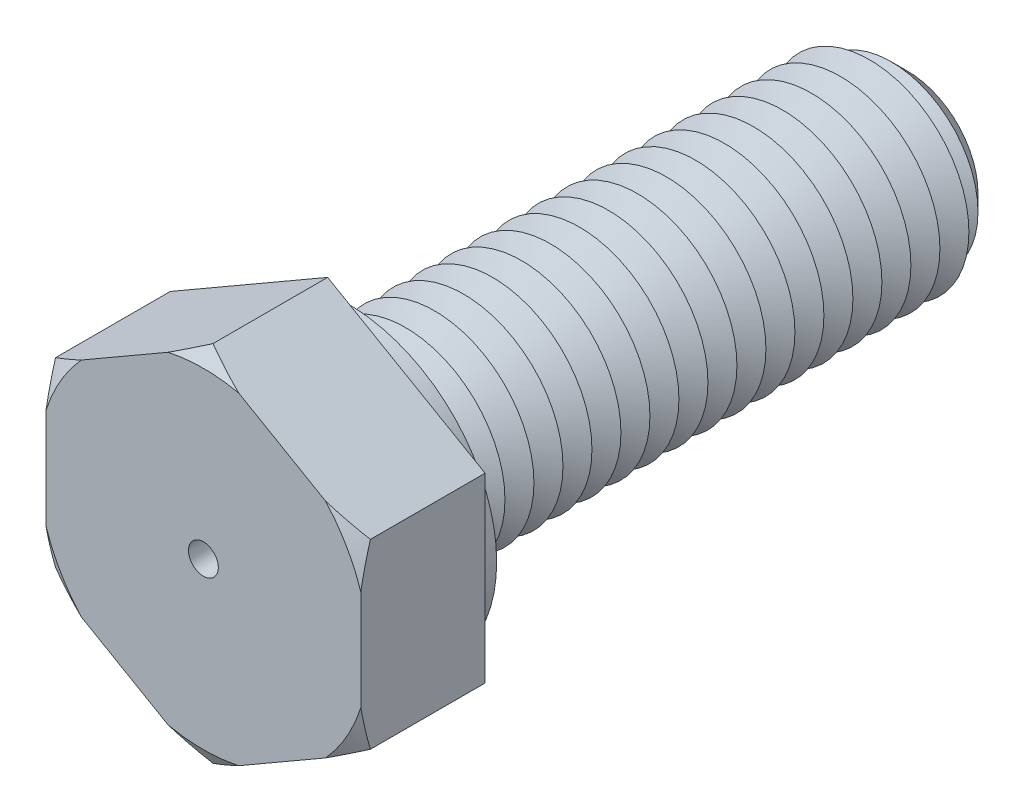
ISO-10303-21;
HEADER;
FILE_DESCRIPTION(('STEP AP214'),'2;1');
FILE_NAME('part.step','',(''),(''),'','','');
FILE_SCHEMA(('AUTOMOTIVE_DESIGN { 1 0 10303 214 1 1 1 1 }'));
ENDSEC;
DATA;
#1=APPLICATION_CONTEXT('core data for automotive mechanical design processes');
#2=APPLICATION_PROTOCOL_DEFINITION('international standard','automotive_design',2000,#1);
#3=PRODUCT_CONTEXT('',#1,'mechanical');
#4=PRODUCT('Part','Part','',(#3));
#5=PRODUCT_RELATED_PRODUCT_CATEGORY('part','',(#4));
#6=PRODUCT_DEFINITION_FORMATION('','',#4);
#7=PRODUCT_DEFINITION_CONTEXT('part definition',#1,'design');
#8=PRODUCT_DEFINITION('design','',#6,#7);
#9=PRODUCT_DEFINITION_SHAPE('','',#8);
#10=(LENGTH_UNIT() NAMED_UNIT(*) SI_UNIT(.MILLI.,.METRE.));
#11=(NAMED_UNIT(*) PLANE_ANGLE_UNIT() SI_UNIT($,.RADIAN.));
#12=(NAMED_UNIT(*) SI_UNIT($,.STERADIAN.) SOLID_ANGLE_UNIT());
#13=UNCERTAINTY_MEASURE_WITH_UNIT(LENGTH_MEASURE(1.E-05),#10,'distance_accuracy_value','');
#14=(GEOMETRIC_REPRESENTATION_CONTEXT(3) GLOBAL_UNCERTAINTY_ASSIGNED_CONTEXT((#13)) GLOBAL_UNIT_ASSIGNED_CONTEXT((#10,
#11,#12)) REPRESENTATION_CONTEXT('',''));
#15=CARTESIAN_POINT('',(0.,0.,0.));
#16=DIRECTION('',(0.,0.,1.));
#17=DIRECTION('',(1.,0.,0.));
#18=AXIS2_PLACEMENT_3D('',#15,#16,#17);
#19=CARTESIAN_POINT('',(9.5,5.48482755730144,7.5));
#20=DIRECTION('',(-0.5,-0.866025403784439,0.));
#21=DIRECTION('',(0.866025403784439,-0.5,0.));
#22=AXIS2_PLACEMENT_3D('',#19,#20,#21);
#23=PLANE('',#22);
#24=CARTESIAN_POINT('',(16.0911028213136,1.67945256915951,3.91531658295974));
#25=CARTESIAN_POINT('',(15.7926530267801,1.85176263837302,4.07633378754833));
#26=CARTESIAN_POINT('',(15.4934885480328,2.02448533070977,4.23561185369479));
#27=CARTESIAN_POINT('',(14.8934288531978,2.37092995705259,4.54987291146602));
#28=CARTESIAN_POINT('',(14.5925334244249,2.54465201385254,4.70485536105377));
#29=CARTESIAN_POINT('',(13.9878148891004,2.89378642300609,5.01015744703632));
#30=CARTESIAN_POINT('',(13.6839854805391,3.06920241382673,5.16046049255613));
#31=CARTESIAN_POINT('',(13.0740489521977,3.4213494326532,5.45475890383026));
#32=CARTESIAN_POINT('',(12.7679419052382,3.59808041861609,5.59875447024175));
#33=CARTESIAN_POINT('',(12.1452865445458,3.95757065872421,5.88261207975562));
#34=CARTESIAN_POINT('',(11.8286703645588,4.14036909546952,6.02227655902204));
#35=CARTESIAN_POINT('',(11.1922429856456,4.50781061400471,6.29164435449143));
#36=CARTESIAN_POINT('',(10.8724316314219,4.69245378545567,6.42134718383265));
#37=CARTESIAN_POINT('',(10.2295404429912,5.06362718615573,6.66831982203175));
#38=CARTESIAN_POINT('',(9.90646410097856,5.25015539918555,6.78560163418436));
#39=CARTESIAN_POINT('',(9.2565183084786,5.62540177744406,7.00502233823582));
#40=CARTESIAN_POINT('',(8.92964935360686,5.81411965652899,7.1071631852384));
#41=CARTESIAN_POINT('',(8.14786487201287,6.26548313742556,7.32807954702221));
#42=CARTESIAN_POINT('',(7.6911273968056,6.52918064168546,7.43861218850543));
#43=CARTESIAN_POINT('',(7.00135730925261,6.92741958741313,7.57140056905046));
#44=CARTESIAN_POINT('',(6.77066782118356,7.06060822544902,7.61016053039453));
#45=CARTESIAN_POINT('',(6.30799755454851,7.3277310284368,7.6757081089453));
#46=CARTESIAN_POINT('',(6.07601678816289,7.46166518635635,7.70249583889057));
#47=CARTESIAN_POINT('',(5.61390562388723,7.72846519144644,7.74308971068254));
#48=CARTESIAN_POINT('',(5.38378495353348,7.86132542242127,7.75704275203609));
#49=CARTESIAN_POINT('',(4.92322735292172,8.1272284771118,7.77208284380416));
#50=CARTESIAN_POINT('',(4.69279042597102,8.26027129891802,7.7731700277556));
#51=CARTESIAN_POINT('',(4.23214422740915,8.52622550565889,7.76244373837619));
#52=CARTESIAN_POINT('',(4.00193495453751,8.65913689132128,7.7506303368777));
#53=CARTESIAN_POINT('',(3.54223236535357,8.92454630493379,7.71446028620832));
#54=CARTESIAN_POINT('',(3.31273916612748,9.05704426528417,7.69010168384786));
#55=CARTESIAN_POINT('',(2.77042202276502,9.37015121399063,7.61833387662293));
#56=CARTESIAN_POINT('',(2.45810922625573,9.55046509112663,7.56573497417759));
#57=CARTESIAN_POINT('',(1.83647686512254,9.90936470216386,7.44074774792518));
#58=CARTESIAN_POINT('',(1.52715774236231,10.087950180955,7.36835654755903));
#59=CARTESIAN_POINT('',(0.911549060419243,10.4433720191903,7.20651778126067));
#60=CARTESIAN_POINT('',(0.605263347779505,10.6202061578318,7.1170509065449));
#61=CARTESIAN_POINT('',(-0.00386858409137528,10.9718886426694,6.92387899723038));
#62=CARTESIAN_POINT('',(-0.30671501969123,11.1467371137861,6.8201748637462));
#63=CARTESIAN_POINT('',(-0.912759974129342,11.496637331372,6.59968787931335));
#64=CARTESIAN_POINT('',(-1.21591973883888,11.6716667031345,6.48276398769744));
#65=CARTESIAN_POINT('',(-1.8190277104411,12.0198712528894,6.23911056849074));
#66=CARTESIAN_POINT('',(-2.11897790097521,12.1930475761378,6.11238754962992));
#67=CARTESIAN_POINT('',(-2.71614501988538,12.5378221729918,5.85087494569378));
#68=CARTESIAN_POINT('',(-3.01336251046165,12.7094207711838,5.71608706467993));
#69=CARTESIAN_POINT('',(-3.60546807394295,13.0512730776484,5.43985672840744));
#70=CARTESIAN_POINT('',(-3.90035610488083,13.2215267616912,5.29841415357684));
#71=CARTESIAN_POINT('',(-4.39671248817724,13.5080982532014,5.05486951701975));
#72=CARTESIAN_POINT('',(-4.59871463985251,13.624724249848,4.95421186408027));
#73=CARTESIAN_POINT('',(-5.00183994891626,13.8574687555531,4.75059724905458));
#74=CARTESIAN_POINT('',(-5.20296313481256,13.9735872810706,4.647640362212));
#75=CARTESIAN_POINT('',(-5.60231741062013,14.2041545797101,4.44078592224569));
#76=CARTESIAN_POINT('',(-5.80055672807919,14.3186081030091,4.33690951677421));
#77=CARTESIAN_POINT('',(-6.19633679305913,14.5471118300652,4.12738601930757));
#78=CARTESIAN_POINT('',(-6.39387752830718,14.6611620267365,4.02173889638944));
#79=CARTESIAN_POINT('',(-6.59110282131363,14.7750301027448,3.91531658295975));
#80=B_SPLINE_CURVE_WITH_KNOTS('',3,(#24,#25,#26,#27,#28,#29,#30,#31,#32,#33,#34,#35,#36,#37,#38,
#39,#40,#41,#42,#43,#44,#45,#46,#47,#48,#49,#50,#51,#52,#53,#54,#55,#56,#57,#58,#59,#60,#61,#62,
#63,#64,#65,#66,#67,#68,#69,#70,#71,#72,#73,#74,#75,#76,#77,#78,#79),.UNSPECIFIED.,.F.,.F.,(4,2,
2,2,2,2,2,2,2,2,2,2,2,2,2,2,2,2,2,2,2,2,2,2,2,2,2,4),(0.,1.14115474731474,2.28245284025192,
3.42741980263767,4.57235031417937,5.74632926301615,6.92036555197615,8.09325673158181,
9.26599632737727,10.8807998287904,11.6881240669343,12.4954407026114,13.2933978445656,
14.0913467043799,14.8892911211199,15.6873598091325,16.7800286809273,17.8728564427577,
18.9669273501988,20.0609290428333,21.1679585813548,22.2742590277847,23.380326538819,
24.4864139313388,25.2485345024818,26.010630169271,26.7647435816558,27.5188701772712),.UNSPECIFIED.);
#81=CARTESIAN_POINT('',(9.5,5.48482755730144,6.92264973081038));
#82=VERTEX_POINT('',#81);
#83=CARTESIAN_POINT('',(7.36878164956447,6.71528704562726,7.5));
#84=VERTEX_POINT('',#83);
#85=EDGE_CURVE('E132',#82,#84,#80,.T.);
#86=ORIENTED_EDGE('',*,*,#85,.F.);
#87=DIRECTION('',(0.,0.,-1.));
#88=VECTOR('',#87,1.);
#89=CARTESIAN_POINT('',(9.5,5.48482755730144,7.5));
#90=LINE('',#89,#88);
#91=CARTESIAN_POINT('',(9.5,5.48482755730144,0.));
#92=VERTEX_POINT('',#91);
#93=EDGE_CURVE('E144',#82,#92,#90,.T.);
#94=ORIENTED_EDGE('',*,*,#93,.T.);
#95=DIRECTION('',(-0.866025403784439,0.5,0.));
#96=VECTOR('',#95,1.);
#97=CARTESIAN_POINT('',(9.5,5.48482755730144,0.));
#98=LINE('',#97,#96);
#99=CARTESIAN_POINT('',(0.,10.9696551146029,0.));
#100=VERTEX_POINT('',#99);
#101=EDGE_CURVE('E355',#92,#100,#98,.T.);
#102=ORIENTED_EDGE('',*,*,#101,.T.);
#103=DIRECTION('',(0.,0.,-1.));
#104=VECTOR('',#103,1.);
#105=CARTESIAN_POINT('',(0.,10.9696551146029,7.5));
#106=LINE('',#105,#104);
#107=CARTESIAN_POINT('',(0.,10.9696551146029,6.92264973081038));
#108=VERTEX_POINT('',#107);
#109=EDGE_CURVE('E179',#108,#100,#106,.T.);
#110=ORIENTED_EDGE('',*,*,#109,.F.);
#111=CARTESIAN_POINT('',(2.13121835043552,9.73919562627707,7.5));
#112=VERTEX_POINT('',#111);
#113=EDGE_CURVE('E151',#112,#108,#80,.T.);
#114=ORIENTED_EDGE('',*,*,#113,.F.);
#115=DIRECTION('',(-0.866025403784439,0.5,0.));
#116=VECTOR('',#115,1.);
#117=CARTESIAN_POINT('',(9.5,5.48482755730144,7.5));
#118=LINE('',#117,#116);
#119=EDGE_CURVE('E148',#84,#112,#118,.T.);
#120=ORIENTED_EDGE('',*,*,#119,.F.);
#121=EDGE_LOOP('',(#86,#94,#102,#110,#114,#120));
#122=FACE_BOUND('',#121,.T.);
#123=ADVANCED_FACE('F39',(#122),#23,.F.);
#124=CARTESIAN_POINT('',(0.,10.9696551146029,7.5));
#125=DIRECTION('',(0.5,-0.866025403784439,0.));
#126=DIRECTION('',(0.866025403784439,0.5,0.));
#127=AXIS2_PLACEMENT_3D('',#124,#125,#126);
#128=PLANE('',#127);
#129=CARTESIAN_POINT('',(6.59110282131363,14.7750301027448,3.91531658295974));
#130=CARTESIAN_POINT('',(6.29265302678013,14.6027200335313,4.07633378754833));
#131=CARTESIAN_POINT('',(5.99348854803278,14.4299973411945,4.23561185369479));
#132=CARTESIAN_POINT('',(5.3934288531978,14.0835527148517,4.54987291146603));
#133=CARTESIAN_POINT('',(5.09253342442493,13.9098306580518,4.70485536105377));
#134=CARTESIAN_POINT('',(4.48781488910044,13.5606962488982,5.01015744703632));
#135=CARTESIAN_POINT('',(4.18398548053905,13.3852802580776,5.16046049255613));
#136=CARTESIAN_POINT('',(3.5740489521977,13.0331332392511,5.45475890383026));
#137=CARTESIAN_POINT('',(3.26794190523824,12.8564022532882,5.59875447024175));
#138=CARTESIAN_POINT('',(2.64528654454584,12.4969120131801,5.88261207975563));
#139=CARTESIAN_POINT('',(2.32867036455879,12.3141135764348,6.02227655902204));
#140=CARTESIAN_POINT('',(1.69224298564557,11.9466720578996,6.29164435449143));
#141=CARTESIAN_POINT('',(1.37243163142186,11.7620288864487,6.42134718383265));
#142=CARTESIAN_POINT('',(0.729540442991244,11.3908554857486,6.66831982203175));
#143=CARTESIAN_POINT('',(0.406464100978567,11.2043272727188,6.78560163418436));
#144=CARTESIAN_POINT('',(-0.243481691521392,10.8290808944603,7.00502233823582));
#145=CARTESIAN_POINT('',(-0.570350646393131,10.6403630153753,7.1071631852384));
#146=CARTESIAN_POINT('',(-1.35213512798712,10.1889995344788,7.32807954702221));
#147=CARTESIAN_POINT('',(-1.80887260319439,9.92530203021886,7.43861218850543));
#148=CARTESIAN_POINT('',(-2.49864269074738,9.52706308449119,7.57140056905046));
#149=CARTESIAN_POINT('',(-2.72933217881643,9.39387444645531,7.61016053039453));
#150=CARTESIAN_POINT('',(-3.19200244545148,9.12675164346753,7.6757081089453));
#151=CARTESIAN_POINT('',(-3.4239832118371,8.99281748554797,7.70249583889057));
#152=CARTESIAN_POINT('',(-3.88609437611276,8.72601748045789,7.74308971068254));
#153=CARTESIAN_POINT('',(-4.11621504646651,8.59315724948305,7.75704275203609));
#154=CARTESIAN_POINT('',(-4.57677264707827,8.32725419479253,7.77208284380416));
#155=CARTESIAN_POINT('',(-4.80720957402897,8.19421137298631,7.7731700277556));
#156=CARTESIAN_POINT('',(-5.26785577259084,7.92825716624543,7.76244373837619));
#157=CARTESIAN_POINT('',(-5.49806504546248,7.79534578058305,7.7506303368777));
#158=CARTESIAN_POINT('',(-5.95776763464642,7.52993636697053,7.71446028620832));
#159=CARTESIAN_POINT('',(-6.18726083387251,7.39743840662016,7.69010168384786));
#160=CARTESIAN_POINT('',(-6.72957797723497,7.0843314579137,7.61833387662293));
#161=CARTESIAN_POINT('',(-7.04189077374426,6.90401758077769,7.56573497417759));
#162=CARTESIAN_POINT('',(-7.66352313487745,6.54511796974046,7.44074774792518));
#163=CARTESIAN_POINT('',(-7.97284225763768,6.36653249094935,7.36835654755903));
#164=CARTESIAN_POINT('',(-8.58845093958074,6.01111065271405,7.20651778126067));
#165=CARTESIAN_POINT('',(-8.89473665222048,5.83427651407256,7.1170509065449));
#166=CARTESIAN_POINT('',(-9.50386858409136,5.48259402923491,6.92387899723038));
#167=CARTESIAN_POINT('',(-9.80671501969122,5.30774555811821,6.8201748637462));
#168=CARTESIAN_POINT('',(-10.4127599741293,4.95784534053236,6.59968787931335));
#169=CARTESIAN_POINT('',(-10.7159197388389,4.78281596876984,6.48276398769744));
#170=CARTESIAN_POINT('',(-11.3190277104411,4.43461141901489,6.23911056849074));
#171=CARTESIAN_POINT('',(-11.6189779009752,4.26143509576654,6.11238754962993));
#172=CARTESIAN_POINT('',(-12.2161450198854,3.91666049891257,5.85087494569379));
#173=CARTESIAN_POINT('',(-12.5133625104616,3.74506190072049,5.71608706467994));
#174=CARTESIAN_POINT('',(-13.1054680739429,3.40320959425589,5.43985672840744));
#175=CARTESIAN_POINT('',(-13.4003561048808,3.2329559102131,5.29841415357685));
#176=CARTESIAN_POINT('',(-13.8967124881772,2.94638441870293,5.05486951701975));
#177=CARTESIAN_POINT('',(-14.0987146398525,2.82975842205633,4.95421186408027));
#178=CARTESIAN_POINT('',(-14.5018399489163,2.59701391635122,4.75059724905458));
#179=CARTESIAN_POINT('',(-14.7029631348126,2.48089539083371,4.647640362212));
#180=CARTESIAN_POINT('',(-15.1023174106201,2.25032809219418,4.44078592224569));
#181=CARTESIAN_POINT('',(-15.3005567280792,2.13587456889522,4.33690951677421));
#182=CARTESIAN_POINT('',(-15.6963367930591,1.90737084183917,4.12738601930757));
#183=CARTESIAN_POINT('',(-15.8938775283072,1.79332064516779,4.02173889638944));
#184=CARTESIAN_POINT('',(-16.0911028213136,1.67945256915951,3.91531658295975));
#185=B_SPLINE_CURVE_WITH_KNOTS('',3,(#129,#130,#131,#132,#133,#134,#135,#136,#137,#138,#139,
#140,#141,#142,#143,#144,#145,#146,#147,#148,#149,#150,#151,#152,#153,#154,#155,#156,#157,#158,
#159,#160,#161,#162,#163,#164,#165,#166,#167,#168,#169,#170,#171,#172,#173,#174,#175,#176,#177,
#178,#179,#180,#181,#182,#183,#184),.UNSPECIFIED.,.F.,.F.,(4,2,2,2,2,2,2,2,2,2,2,2,2,2,2,2,2,2,
2,2,2,2,2,2,2,2,2,4),(0.,1.14115474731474,2.28245284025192,3.42741980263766,4.57235031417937,
5.74632926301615,6.92036555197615,8.09325673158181,9.26599632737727,10.8807998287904,
11.6881240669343,12.4954407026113,13.2933978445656,14.0913467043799,14.8892911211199,
15.6873598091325,16.7800286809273,17.8728564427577,18.9669273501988,20.0609290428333,
21.1679585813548,22.2742590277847,23.380326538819,24.4864139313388,25.2485345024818,
26.010630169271,26.7647435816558,27.5188701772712),.UNSPECIFIED.);
#186=CARTESIAN_POINT('',(-2.13121835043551,9.73919562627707,7.5));
#187=VERTEX_POINT('',#186);
#188=EDGE_CURVE('E1073',#108,#187,#185,.T.);
#189=ORIENTED_EDGE('',*,*,#188,.F.);
#190=ORIENTED_EDGE('',*,*,#109,.T.);
#191=DIRECTION('',(-0.866025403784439,-0.5,0.));
#192=VECTOR('',#191,1.);
#193=CARTESIAN_POINT('',(0.,10.9696551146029,0.));
#194=LINE('',#193,#192);
#195=CARTESIAN_POINT('',(-9.5,5.48482755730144,0.));
#196=VERTEX_POINT('',#195);
#197=EDGE_CURVE('E375',#100,#196,#194,.T.);
#198=ORIENTED_EDGE('',*,*,#197,.T.);
#199=DIRECTION('',(0.,0.,-1.));
#200=VECTOR('',#199,1.);
#201=CARTESIAN_POINT('',(-9.5,5.48482755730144,7.5));
#202=LINE('',#201,#200);
#203=CARTESIAN_POINT('',(-9.5,5.48482755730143,6.92264973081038));
#204=VERTEX_POINT('',#203);
#205=EDGE_CURVE('E176',#204,#196,#202,.T.);
#206=ORIENTED_EDGE('',*,*,#205,.F.);
#207=CARTESIAN_POINT('',(-7.36878164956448,6.71528704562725,7.5));
#208=VERTEX_POINT('',#207);
#209=EDGE_CURVE('E457',#208,#204,#185,.T.);
#210=ORIENTED_EDGE('',*,*,#209,.F.);
#211=DIRECTION('',(-0.866025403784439,-0.5,0.));
#212=VECTOR('',#211,1.);
#213=CARTESIAN_POINT('',(0.,10.9696551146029,7.5));
#214=LINE('',#213,#212);
#215=EDGE_CURVE('E358',#187,#208,#214,.T.);
#216=ORIENTED_EDGE('',*,*,#215,.F.);
#217=EDGE_LOOP('',(#189,#190,#198,#206,#210,#216));
#218=FACE_BOUND('',#217,.T.);
#219=ADVANCED_FACE('F466',(#218),#128,.F.);
#220=CARTESIAN_POINT('',(-9.5,5.48482755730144,7.5));
#221=DIRECTION('',(1.,0.,0.));
#222=DIRECTION('',(0.,1.,0.));
#223=AXIS2_PLACEMENT_3D('',#220,#221,#222);
#224=PLANE('',#223);
#225=CARTESIAN_POINT('',(-9.5,12.0759303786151,4.38509256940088));
#226=CARTESIAN_POINT('',(-9.5,11.7327439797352,4.5407773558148));
#227=CARTESIAN_POINT('',(-9.5,11.388618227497,4.69443095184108));
#228=CARTESIAN_POINT('',(-9.5,10.698085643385,4.99669009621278));
#229=CARTESIAN_POINT('',(-9.5,10.3516784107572,5.1452947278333));
#230=CARTESIAN_POINT('',(-9.5,9.65484997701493,5.43702212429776));
#231=CARTESIAN_POINT('',(-9.5,9.30441804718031,5.58011936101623));
#232=CARTESIAN_POINT('',(-9.5,8.60059023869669,5.85880989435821));
#233=CARTESIAN_POINT('',(-9.5,8.24719449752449,5.9944035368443));
#234=CARTESIAN_POINT('',(-9.5,7.53860340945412,6.25582574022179));
#235=CARTESIAN_POINT('',(-9.5,7.18342337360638,6.38169559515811));
#236=CARTESIAN_POINT('',(-9.5,6.46926569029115,6.62229858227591));
#237=CARTESIAN_POINT('',(-9.5,6.11028785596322,6.73703116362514));
#238=CARTESIAN_POINT('',(-9.5,5.38872372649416,6.95272419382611));
#239=CARTESIAN_POINT('',(-9.5,5.02614305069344,7.05370330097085));
#240=CARTESIAN_POINT('',(-9.5,4.29675196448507,7.23920160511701));
#241=CARTESIAN_POINT('',(-9.5,3.92994173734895,7.32372151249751));
#242=CARTESIAN_POINT('',(-9.5,3.29665308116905,7.45205940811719));
#243=CARTESIAN_POINT('',(-9.5,3.03113701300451,7.50062833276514));
#244=CARTESIAN_POINT('',(-9.5,2.49832809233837,7.5865841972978));
#245=CARTESIAN_POINT('',(-9.5,2.23103554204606,7.62397299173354));
#246=CARTESIAN_POINT('',(-9.5,1.69506861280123,7.68659004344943));
#247=CARTESIAN_POINT('',(-9.5,1.42639449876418,7.71182055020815));
#248=CARTESIAN_POINT('',(-9.5,0.888138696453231,7.74939803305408));
#249=CARTESIAN_POINT('',(-9.5,0.618557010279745,7.76174503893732));
#250=CARTESIAN_POINT('',(-9.5,0.0792458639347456,7.77317034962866));
#251=CARTESIAN_POINT('',(-9.5,-0.190483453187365,7.77225534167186));
#252=CARTESIAN_POINT('',(-9.5,-0.729567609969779,7.75720205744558));
#253=CARTESIAN_POINT('',(-9.5,-0.998922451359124,7.74306384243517));
#254=CARTESIAN_POINT('',(-9.5,-1.53667618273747,7.70199575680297));
#255=CARTESIAN_POINT('',(-9.5,-1.80507496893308,7.67506453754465));
#256=CARTESIAN_POINT('',(-9.5,-2.34038611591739,7.60918517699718));
#257=CARTESIAN_POINT('',(-9.5,-2.60729841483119,7.57023653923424));
#258=CARTESIAN_POINT('',(-9.5,-3.27166409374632,7.45918941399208));
#259=CARTESIAN_POINT('',(-9.5,-3.66797754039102,7.38023980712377));
#260=CARTESIAN_POINT('',(-9.5,-4.45585575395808,7.20141943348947));
#261=CARTESIAN_POINT('',(-9.5,-4.8474194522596,7.10154404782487));
#262=CARTESIAN_POINT('',(-9.5,-5.6265713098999,6.88438943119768));
#263=CARTESIAN_POINT('',(-9.5,-6.01414884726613,6.76707245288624));
#264=CARTESIAN_POINT('',(-9.5,-6.78474185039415,6.51851091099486));
#265=CARTESIAN_POINT('',(-9.5,-7.16775763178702,6.38726731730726));
#266=CARTESIAN_POINT('',(-9.5,-7.93407213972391,6.11202298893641));
#267=CARTESIAN_POINT('',(-9.5,-8.31732458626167,5.96789419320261));
#268=CARTESIAN_POINT('',(-9.5,-9.08024927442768,5.67043108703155));
#269=CARTESIAN_POINT('',(-9.5,-9.4599212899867,5.51709619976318));
#270=CARTESIAN_POINT('',(-9.5,-10.2138362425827,5.20397874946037));
#271=CARTESIAN_POINT('',(-9.5,-10.5880982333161,5.04424191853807));
#272=CARTESIAN_POINT('',(-9.5,-11.1474871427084,4.80018423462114));
#273=CARTESIAN_POINT('',(-9.5,-11.3335947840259,4.71809930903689));
#274=CARTESIAN_POINT('',(-9.5,-11.7052038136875,4.55257683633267));
#275=CARTESIAN_POINT('',(-9.5,-11.8907052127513,4.46913931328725));
#276=CARTESIAN_POINT('',(-9.5,-12.0759303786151,4.38509256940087));
#277=B_SPLINE_CURVE_WITH_KNOTS('',3,(#225,#226,#227,#228,#229,#230,#231,#232,#233,#234,#235,
#236,#237,#238,#239,#240,#241,#242,#243,#244,#245,#246,#247,#248,#249,#250,#251,#252,#253,#254,
#255,#256,#257,#258,#259,#260,#261,#262,#263,#264,#265,#266,#267,#268,#269,#270,#271,#272,#273,
#274,#275,#276),.UNSPECIFIED.,.F.,.F.,(4,2,2,2,2,2,2,2,2,2,2,2,2,2,2,2,2,2,2,2,2,2,2,2,2,4),(0.,
1.13056270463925,2.26132959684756,3.39682602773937,4.53227007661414,5.66259174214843,
6.79296928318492,7.92179771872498,9.0505774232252,9.86013572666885,10.6695596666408,
11.4788337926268,12.288106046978,13.0969702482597,13.9058307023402,14.7147764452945,
15.5237556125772,16.7353316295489,17.9471753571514,19.1616810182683,20.3761021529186,
21.6043286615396,22.8326322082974,24.0533405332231,24.6635541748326,25.273756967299),.UNSPECIFIED.);
#278=CARTESIAN_POINT('',(-9.5,3.02390858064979,7.5));
#279=VERTEX_POINT('',#278);
#280=EDGE_CURVE('E456',#204,#279,#277,.T.);
#281=ORIENTED_EDGE('',*,*,#280,.F.);
#282=ORIENTED_EDGE('',*,*,#205,.T.);
#283=DIRECTION('',(0.,-1.,0.));
#284=VECTOR('',#283,1.);
#285=CARTESIAN_POINT('',(-9.5,5.48482755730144,0.));
#286=LINE('',#285,#284);
#287=CARTESIAN_POINT('',(-9.5,-5.48482755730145,0.));
#288=VERTEX_POINT('',#287);
#289=EDGE_CURVE('E379',#196,#288,#286,.T.);
#290=ORIENTED_EDGE('',*,*,#289,.T.);
#291=DIRECTION('',(0.,0.,-1.));
#292=VECTOR('',#291,1.);
#293=CARTESIAN_POINT('',(-9.5,-5.48482755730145,7.5));
#294=LINE('',#293,#292);
#295=CARTESIAN_POINT('',(-9.49999999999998,-5.48482755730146,6.92264973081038));
#296=VERTEX_POINT('',#295);
#297=EDGE_CURVE('E173',#296,#288,#294,.T.);
#298=ORIENTED_EDGE('',*,*,#297,.F.);
#299=CARTESIAN_POINT('',(-9.5,-3.02390858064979,7.5));
#300=VERTEX_POINT('',#299);
#301=EDGE_CURVE('E402',#300,#296,#277,.T.);
#302=ORIENTED_EDGE('',*,*,#301,.F.);
#303=DIRECTION('',(0.,-1.,0.));
#304=VECTOR('',#303,1.);
#305=CARTESIAN_POINT('',(-9.5,5.48482755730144,7.5));
#306=LINE('',#305,#304);
#307=EDGE_CURVE('E362',#279,#300,#306,.T.);
#308=ORIENTED_EDGE('',*,*,#307,.F.);
#309=EDGE_LOOP('',(#281,#282,#290,#298,#302,#308));
#310=FACE_BOUND('',#309,.T.);
#311=ADVANCED_FACE('F462',(#310),#224,.F.);
#312=CARTESIAN_POINT('',(-9.5,-5.48482755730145,7.5));
#313=DIRECTION('',(0.5,0.866025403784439,0.));
#314=DIRECTION('',(-0.866025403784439,0.5,0.));
#315=AXIS2_PLACEMENT_3D('',#312,#313,#314);
#316=PLANE('',#315);
#317=CARTESIAN_POINT('',(-16.0911028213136,-1.67945256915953,3.91531658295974));
#318=CARTESIAN_POINT('',(-15.7926530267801,-1.85176263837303,4.07633378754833));
#319=CARTESIAN_POINT('',(-15.4934885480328,-2.02448533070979,4.23561185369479));
#320=CARTESIAN_POINT('',(-14.8934288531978,-2.37092995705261,4.54987291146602));
#321=CARTESIAN_POINT('',(-14.5925334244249,-2.54465201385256,4.70485536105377));
#322=CARTESIAN_POINT('',(-13.9878148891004,-2.89378642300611,5.01015744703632));
#323=CARTESIAN_POINT('',(-13.683985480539,-3.06920241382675,5.16046049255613));
#324=CARTESIAN_POINT('',(-13.0740489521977,-3.42134943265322,5.45475890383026));
#325=CARTESIAN_POINT('',(-12.7679419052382,-3.5980804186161,5.59875447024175));
#326=CARTESIAN_POINT('',(-12.1452865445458,-3.95757065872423,5.88261207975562));
#327=CARTESIAN_POINT('',(-11.8286703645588,-4.14036909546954,6.02227655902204));
#328=CARTESIAN_POINT('',(-11.1922429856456,-4.50781061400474,6.29164435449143));
#329=CARTESIAN_POINT('',(-10.8724316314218,-4.69245378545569,6.42134718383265));
#330=CARTESIAN_POINT('',(-10.2295404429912,-5.06362718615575,6.66831982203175));
#331=CARTESIAN_POINT('',(-9.90646410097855,-5.25015539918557,6.78560163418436));
#332=CARTESIAN_POINT('',(-9.25651830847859,-5.62540177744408,7.00502233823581));
#333=CARTESIAN_POINT('',(-8.92964935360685,-5.81411965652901,7.1071631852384));
#334=CARTESIAN_POINT('',(-8.14786487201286,-6.26548313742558,7.32807954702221));
#335=CARTESIAN_POINT('',(-7.69112739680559,-6.52918064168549,7.43861218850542));
#336=CARTESIAN_POINT('',(-7.0013573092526,-6.92741958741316,7.57140056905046));
#337=CARTESIAN_POINT('',(-6.77066782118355,-7.06060822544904,7.61016053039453));
#338=CARTESIAN_POINT('',(-6.3079975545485,-7.32773102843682,7.6757081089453));
#339=CARTESIAN_POINT('',(-6.07601678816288,-7.46166518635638,7.70249583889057));
#340=CARTESIAN_POINT('',(-5.61390562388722,-7.72846519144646,7.74308971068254));
#341=CARTESIAN_POINT('',(-5.38378495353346,-7.8613254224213,7.75704275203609));
#342=CARTESIAN_POINT('',(-4.9232273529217,-8.12722847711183,7.77208284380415));
#343=CARTESIAN_POINT('',(-4.692790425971,-8.26027129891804,7.77317002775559));
#344=CARTESIAN_POINT('',(-4.23214422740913,-8.52622550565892,7.76244373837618));
#345=CARTESIAN_POINT('',(-4.00193495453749,-8.6591368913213,7.75063033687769));
#346=CARTESIAN_POINT('',(-3.54223236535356,-8.92454630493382,7.71446028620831));
#347=CARTESIAN_POINT('',(-3.31273916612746,-9.05704426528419,7.69010168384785));
#348=CARTESIAN_POINT('',(-2.770422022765,-9.37015121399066,7.61833387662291));
#349=CARTESIAN_POINT('',(-2.45810922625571,-9.55046509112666,7.56573497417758));
#350=CARTESIAN_POINT('',(-1.83647686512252,-9.9093647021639,7.44074774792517));
#351=CARTESIAN_POINT('',(-1.52715774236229,-10.087950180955,7.36835654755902));
#352=CARTESIAN_POINT('',(-0.911549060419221,-10.4433720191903,7.20651778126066));
#353=CARTESIAN_POINT('',(-0.605263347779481,-10.6202061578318,7.11705090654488));
#354=CARTESIAN_POINT('',(0.00386858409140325,-10.9718886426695,6.92387899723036));
#355=CARTESIAN_POINT('',(0.30671501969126,-11.1467371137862,6.82017486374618));
#356=CARTESIAN_POINT('',(0.912759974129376,-11.496637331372,6.59968787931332));
#357=CARTESIAN_POINT('',(1.21591973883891,-11.6716667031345,6.48276398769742));
#358=CARTESIAN_POINT('',(1.81902771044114,-12.0198712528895,6.23911056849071));
#359=CARTESIAN_POINT('',(2.11897790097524,-12.1930475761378,6.11238754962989));
#360=CARTESIAN_POINT('',(2.71614501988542,-12.5378221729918,5.85087494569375));
#361=CARTESIAN_POINT('',(3.01336251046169,-12.7094207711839,5.7160870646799));
#362=CARTESIAN_POINT('',(3.60546807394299,-13.0512730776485,5.4398567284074));
#363=CARTESIAN_POINT('',(3.90035610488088,-13.2215267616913,5.29841415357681));
#364=CARTESIAN_POINT('',(4.39671248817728,-13.5080982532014,5.05486951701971));
#365=CARTESIAN_POINT('',(4.59871463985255,-13.624724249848,4.95421186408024));
#366=CARTESIAN_POINT('',(5.00183994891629,-13.8574687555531,4.75059724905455));
#367=CARTESIAN_POINT('',(5.20296313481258,-13.9735872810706,4.64764036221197));
#368=CARTESIAN_POINT('',(5.60231741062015,-14.2041545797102,4.44078592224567));
#369=CARTESIAN_POINT('',(5.8005567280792,-14.3186081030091,4.33690951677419));
#370=CARTESIAN_POINT('',(6.19633679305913,-14.5471118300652,4.12738601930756));
#371=CARTESIAN_POINT('',(6.39387752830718,-14.6611620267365,4.02173889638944));
#372=CARTESIAN_POINT('',(6.59110282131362,-14.7750301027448,3.91531658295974));
#373=B_SPLINE_CURVE_WITH_KNOTS('',3,(#317,#318,#319,#320,#321,#322,#323,#324,#325,#326,#327,
#328,#329,#330,#331,#332,#333,#334,#335,#336,#337,#338,#339,#340,#341,#342,#343,#344,#345,#346,
#347,#348,#349,#350,#351,#352,#353,#354,#355,#356,#357,#358,#359,#360,#361,#362,#363,#364,#365,
#366,#367,#368,#369,#370,#371,#372),.UNSPECIFIED.,.F.,.F.,(4,2,2,2,2,2,2,2,2,2,2,2,2,2,2,2,2,2,
2,2,2,2,2,2,2,2,2,4),(0.,1.14115474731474,2.28245284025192,3.42741980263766,4.57235031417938,
5.74632926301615,6.92036555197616,8.09325673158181,9.26599632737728,10.8807998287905,
11.6881240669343,12.4954407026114,13.2933978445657,14.0913467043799,14.8892911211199,
15.6873598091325,16.7800286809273,17.8728564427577,18.9669273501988,20.0609290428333,
21.1679585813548,22.2742590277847,23.3803265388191,24.4864139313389,25.2485345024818,
26.010630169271,26.7647435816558,27.5188701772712),.UNSPECIFIED.);
#374=CARTESIAN_POINT('',(-7.36878164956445,-6.71528704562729,7.5));
#375=VERTEX_POINT('',#374);
#376=EDGE_CURVE('E401',#296,#375,#373,.T.);
#377=ORIENTED_EDGE('',*,*,#376,.F.);
#378=ORIENTED_EDGE('',*,*,#297,.T.);
#379=DIRECTION('',(0.866025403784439,-0.5,0.));
#380=VECTOR('',#379,1.);
#381=CARTESIAN_POINT('',(-9.5,-5.48482755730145,0.));
#382=LINE('',#381,#380);
#383=CARTESIAN_POINT('',(0.,-10.9696551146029,0.));
#384=VERTEX_POINT('',#383);
#385=EDGE_CURVE('E383',#288,#384,#382,.T.);
#386=ORIENTED_EDGE('',*,*,#385,.T.);
#387=DIRECTION('',(0.,0.,-1.));
#388=VECTOR('',#387,1.);
#389=CARTESIAN_POINT('',(0.,-10.9696551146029,7.5));
#390=LINE('',#389,#388);
#391=CARTESIAN_POINT('',(0.,-10.9696551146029,6.92264973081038));
#392=VERTEX_POINT('',#391);
#393=EDGE_CURVE('E163',#392,#384,#390,.T.);
#394=ORIENTED_EDGE('',*,*,#393,.F.);
#395=CARTESIAN_POINT('',(-2.13121835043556,-9.73919562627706,7.5));
#396=VERTEX_POINT('',#395);
#397=EDGE_CURVE('E403',#396,#392,#373,.T.);
#398=ORIENTED_EDGE('',*,*,#397,.F.);
#399=DIRECTION('',(0.866025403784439,-0.5,0.));
#400=VECTOR('',#399,1.);
#401=CARTESIAN_POINT('',(-9.5,-5.48482755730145,7.5));
#402=LINE('',#401,#400);
#403=EDGE_CURVE('E366',#375,#396,#402,.T.);
#404=ORIENTED_EDGE('',*,*,#403,.F.);
#405=EDGE_LOOP('',(#377,#378,#386,#394,#398,#404));
#406=FACE_BOUND('',#405,.T.);
#407=ADVANCED_FACE('F465',(#406),#316,.F.);
#408=CARTESIAN_POINT('',(0.,-10.9696551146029,7.5));
#409=DIRECTION('',(-0.5,0.866025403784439,0.));
#410=DIRECTION('',(-0.866025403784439,-0.5,0.));
#411=AXIS2_PLACEMENT_3D('',#408,#409,#410);
#412=PLANE('',#411);
#413=CARTESIAN_POINT('',(-6.59110282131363,-14.7750301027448,3.91531658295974));
#414=CARTESIAN_POINT('',(-6.29265302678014,-14.6027200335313,4.07633378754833));
#415=CARTESIAN_POINT('',(-5.99348854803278,-14.4299973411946,4.23561185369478));
#416=CARTESIAN_POINT('',(-5.3934288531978,-14.0835527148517,4.54987291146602));
#417=CARTESIAN_POINT('',(-5.09253342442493,-13.9098306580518,4.70485536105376));
#418=CARTESIAN_POINT('',(-4.48781488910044,-13.5606962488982,5.01015744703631));
#419=CARTESIAN_POINT('',(-4.18398548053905,-13.3852802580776,5.16046049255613));
#420=CARTESIAN_POINT('',(-3.5740489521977,-13.0331332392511,5.45475890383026));
#421=CARTESIAN_POINT('',(-3.26794190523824,-12.8564022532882,5.59875447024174));
#422=CARTESIAN_POINT('',(-2.64528654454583,-12.4969120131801,5.88261207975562));
#423=CARTESIAN_POINT('',(-2.32867036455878,-12.3141135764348,6.02227655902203));
#424=CARTESIAN_POINT('',(-1.69224298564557,-11.9466720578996,6.29164435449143));
#425=CARTESIAN_POINT('',(-1.37243163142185,-11.7620288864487,6.42134718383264));
#426=CARTESIAN_POINT('',(-0.729540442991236,-11.3908554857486,6.66831982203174));
#427=CARTESIAN_POINT('',(-0.406464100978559,-11.2043272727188,6.78560163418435));
#428=CARTESIAN_POINT('',(0.243481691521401,-10.8290808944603,7.00502233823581));
#429=CARTESIAN_POINT('',(0.570350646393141,-10.6403630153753,7.10716318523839));
#430=CARTESIAN_POINT('',(1.35213512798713,-10.1889995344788,7.3280795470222));
#431=CARTESIAN_POINT('',(1.8088726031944,-9.92530203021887,7.43861218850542));
#432=CARTESIAN_POINT('',(2.49864269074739,-9.5270630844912,7.57140056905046));
#433=CARTESIAN_POINT('',(2.72933217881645,-9.39387444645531,7.61016053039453));
#434=CARTESIAN_POINT('',(3.19200244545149,-9.12675164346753,7.6757081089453));
#435=CARTESIAN_POINT('',(3.42398321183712,-8.99281748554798,7.70249583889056));
#436=CARTESIAN_POINT('',(3.88609437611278,-8.72601748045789,7.74308971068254));
#437=CARTESIAN_POINT('',(4.11621504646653,-8.59315724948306,7.75704275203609));
#438=CARTESIAN_POINT('',(4.57677264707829,-8.32725419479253,7.77208284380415));
#439=CARTESIAN_POINT('',(4.80720957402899,-8.19421137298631,7.77317002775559));
#440=CARTESIAN_POINT('',(5.26785577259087,-7.92825716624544,7.76244373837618));
#441=CARTESIAN_POINT('',(5.4980650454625,-7.79534578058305,7.75063033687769));
#442=CARTESIAN_POINT('',(5.95776763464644,-7.52993636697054,7.71446028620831));
#443=CARTESIAN_POINT('',(6.18726083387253,-7.39743840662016,7.69010168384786));
#444=CARTESIAN_POINT('',(6.72957797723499,-7.0843314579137,7.61833387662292));
#445=CARTESIAN_POINT('',(7.04189077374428,-6.9040175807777,7.56573497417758));
#446=CARTESIAN_POINT('',(7.66352313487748,-6.54511796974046,7.44074774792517));
#447=CARTESIAN_POINT('',(7.97284225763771,-6.36653249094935,7.36835654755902));
#448=CARTESIAN_POINT('',(8.58845093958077,-6.01111065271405,7.20651778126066));
#449=CARTESIAN_POINT('',(8.89473665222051,-5.83427651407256,7.11705090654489));
#450=CARTESIAN_POINT('',(9.50386858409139,-5.48259402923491,6.92387899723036));
#451=CARTESIAN_POINT('',(9.80671501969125,-5.30774555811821,6.82017486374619));
#452=CARTESIAN_POINT('',(10.4127599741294,-4.95784534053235,6.59968787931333));
#453=CARTESIAN_POINT('',(10.7159197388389,-4.78281596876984,6.48276398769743));
#454=CARTESIAN_POINT('',(11.3190277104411,-4.43461141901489,6.23911056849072));
#455=CARTESIAN_POINT('',(11.6189779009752,-4.26143509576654,6.1123875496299));
#456=CARTESIAN_POINT('',(12.2161450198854,-3.91666049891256,5.85087494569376));
#457=CARTESIAN_POINT('',(12.5133625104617,-3.74506190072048,5.71608706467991));
#458=CARTESIAN_POINT('',(13.105468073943,-3.40320959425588,5.43985672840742));
#459=CARTESIAN_POINT('',(13.4003561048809,-3.23295591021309,5.29841415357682));
#460=CARTESIAN_POINT('',(13.8967124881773,-2.94638441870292,5.05486951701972));
#461=CARTESIAN_POINT('',(14.0987146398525,-2.82975842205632,4.95421186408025));
#462=CARTESIAN_POINT('',(14.5018399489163,-2.59701391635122,4.75059724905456));
#463=CARTESIAN_POINT('',(14.7029631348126,-2.48089539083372,4.64764036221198));
#464=CARTESIAN_POINT('',(15.1023174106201,-2.25032809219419,4.44078592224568));
#465=CARTESIAN_POINT('',(15.3005567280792,-2.13587456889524,4.3369095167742));
#466=CARTESIAN_POINT('',(15.6963367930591,-1.90737084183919,4.12738601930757));
#467=CARTESIAN_POINT('',(15.8938775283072,-1.79332064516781,4.02173889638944));
#468=CARTESIAN_POINT('',(16.0911028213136,-1.67945256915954,3.91531658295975));
#469=B_SPLINE_CURVE_WITH_KNOTS('',3,(#413,#414,#415,#416,#417,#418,#419,#420,#421,#422,#423,
#424,#425,#426,#427,#428,#429,#430,#431,#432,#433,#434,#435,#436,#437,#438,#439,#440,#441,#442,
#443,#444,#445,#446,#447,#448,#449,#450,#451,#452,#453,#454,#455,#456,#457,#458,#459,#460,#461,
#462,#463,#464,#465,#466,#467,#468),.UNSPECIFIED.,.F.,.F.,(4,2,2,2,2,2,2,2,2,2,2,2,2,2,2,2,2,2,
2,2,2,2,2,2,2,2,2,4),(0.,1.14115474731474,2.28245284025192,3.42741980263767,4.57235031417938,
5.74632926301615,6.92036555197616,8.09325673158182,9.26599632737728,10.8807998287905,
11.6881240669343,12.4954407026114,13.2933978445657,14.0913467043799,14.8892911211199,
15.6873598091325,16.7800286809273,17.8728564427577,18.9669273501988,20.0609290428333,
21.1679585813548,22.2742590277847,23.3803265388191,24.4864139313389,25.2485345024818,
26.010630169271,26.7647435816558,27.5188701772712),.UNSPECIFIED.);
#470=CARTESIAN_POINT('',(2.13121835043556,-9.73919562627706,7.5));
#471=VERTEX_POINT('',#470);
#472=EDGE_CURVE('E64',#392,#471,#469,.T.);
#473=ORIENTED_EDGE('',*,*,#472,.F.);
#474=ORIENTED_EDGE('',*,*,#393,.T.);
#475=DIRECTION('',(0.866025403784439,0.5,0.));
#476=VECTOR('',#475,1.);
#477=CARTESIAN_POINT('',(0.,-10.9696551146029,0.));
#478=LINE('',#477,#476);
#479=CARTESIAN_POINT('',(9.5,-5.48482755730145,0.));
#480=VERTEX_POINT('',#479);
#481=EDGE_CURVE('E386',#384,#480,#478,.T.);
#482=ORIENTED_EDGE('',*,*,#481,.T.);
#483=DIRECTION('',(0.,0.,-1.));
#484=VECTOR('',#483,1.);
#485=CARTESIAN_POINT('',(9.5,-5.48482755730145,7.5));
#486=LINE('',#485,#484);
#487=CARTESIAN_POINT('',(9.5,-5.48482755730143,6.92264973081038));
#488=VERTEX_POINT('',#487);
#489=EDGE_CURVE('E157',#488,#480,#486,.T.);
#490=ORIENTED_EDGE('',*,*,#489,.F.);
#491=CARTESIAN_POINT('',(7.36878164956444,-6.71528704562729,7.5));
#492=VERTEX_POINT('',#491);
#493=EDGE_CURVE('E411',#492,#488,#469,.T.);
#494=ORIENTED_EDGE('',*,*,#493,.F.);
#495=DIRECTION('',(0.866025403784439,0.5,0.));
#496=VECTOR('',#495,1.);
#497=CARTESIAN_POINT('',(0.,-10.9696551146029,7.5));
#498=LINE('',#497,#496);
#499=EDGE_CURVE('E166',#471,#492,#498,.T.);
#500=ORIENTED_EDGE('',*,*,#499,.F.);
#501=EDGE_LOOP('',(#473,#474,#482,#490,#494,#500));
#502=FACE_BOUND('',#501,.T.);
#503=ADVANCED_FACE('F429',(#502),#412,.F.);
#504=CARTESIAN_POINT('',(9.5,-5.48482755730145,7.5));
#505=DIRECTION('',(-1.,0.,0.));
#506=DIRECTION('',(0.,-1.,0.));
#507=AXIS2_PLACEMENT_3D('',#504,#505,#506);
#508=PLANE('',#507);
#509=CARTESIAN_POINT('',(9.5,-12.0759303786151,4.38509256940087));
#510=CARTESIAN_POINT('',(9.5,-11.7327439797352,4.54077735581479));
#511=CARTESIAN_POINT('',(9.5,-11.388618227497,4.69443095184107));
#512=CARTESIAN_POINT('',(9.5,-10.698085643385,4.99669009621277));
#513=CARTESIAN_POINT('',(9.5,-10.3516784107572,5.14529472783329));
#514=CARTESIAN_POINT('',(9.5,-9.65484997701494,5.43702212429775));
#515=CARTESIAN_POINT('',(9.5,-9.30441804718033,5.58011936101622));
#516=CARTESIAN_POINT('',(9.5,-8.60059023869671,5.8588098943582));
#517=CARTESIAN_POINT('',(9.5,-8.2471944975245,5.99440353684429));
#518=CARTESIAN_POINT('',(9.5,-7.53860340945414,6.25582574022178));
#519=CARTESIAN_POINT('',(9.5,-7.18342337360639,6.3816955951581));
#520=CARTESIAN_POINT('',(9.5,-6.46926569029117,6.6222985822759));
#521=CARTESIAN_POINT('',(9.5,-6.11028785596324,6.73703116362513));
#522=CARTESIAN_POINT('',(9.5,-5.38872372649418,6.95272419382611));
#523=CARTESIAN_POINT('',(9.5,-5.02614305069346,7.05370330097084));
#524=CARTESIAN_POINT('',(9.5,-4.29675196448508,7.239201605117));
#525=CARTESIAN_POINT('',(9.5,-3.92994173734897,7.32372151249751));
#526=CARTESIAN_POINT('',(9.5,-3.29665308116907,7.45205940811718));
#527=CARTESIAN_POINT('',(9.5,-3.03113701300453,7.50062833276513));
#528=CARTESIAN_POINT('',(9.5,-2.49832809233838,7.5865841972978));
#529=CARTESIAN_POINT('',(9.5,-2.23103554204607,7.62397299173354));
#530=CARTESIAN_POINT('',(9.5,-1.69506861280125,7.68659004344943));
#531=CARTESIAN_POINT('',(9.5,-1.4263944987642,7.71182055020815));
#532=CARTESIAN_POINT('',(9.5,-0.888138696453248,7.74939803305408));
#533=CARTESIAN_POINT('',(9.5,-0.618557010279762,7.76174503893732));
#534=CARTESIAN_POINT('',(9.5,-0.0792458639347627,7.77317034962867));
#535=CARTESIAN_POINT('',(9.5,0.190483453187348,7.77225534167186));
#536=CARTESIAN_POINT('',(9.5,0.729567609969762,7.75720205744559));
#537=CARTESIAN_POINT('',(9.5,0.998922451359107,7.74306384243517));
#538=CARTESIAN_POINT('',(9.5,1.53667618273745,7.70199575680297));
#539=CARTESIAN_POINT('',(9.5,1.80507496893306,7.67506453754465));
#540=CARTESIAN_POINT('',(9.5,2.34038611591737,7.60918517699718));
#541=CARTESIAN_POINT('',(9.5,2.60729841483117,7.57023653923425));
#542=CARTESIAN_POINT('',(9.5,3.2716640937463,7.45918941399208));
#543=CARTESIAN_POINT('',(9.5,3.667977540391,7.38023980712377));
#544=CARTESIAN_POINT('',(9.5,4.45585575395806,7.20141943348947));
#545=CARTESIAN_POINT('',(9.5,4.84741945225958,7.10154404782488));
#546=CARTESIAN_POINT('',(9.5,5.62657130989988,6.88438943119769));
#547=CARTESIAN_POINT('',(9.5,6.01414884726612,6.76707245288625));
#548=CARTESIAN_POINT('',(9.5,6.78474185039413,6.51851091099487));
#549=CARTESIAN_POINT('',(9.5,7.167757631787,6.38726731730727));
#550=CARTESIAN_POINT('',(9.5,7.93407213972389,6.11202298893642));
#551=CARTESIAN_POINT('',(9.5,8.31732458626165,5.96789419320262));
#552=CARTESIAN_POINT('',(9.5,9.08024927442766,5.67043108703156));
#553=CARTESIAN_POINT('',(9.5,9.45992128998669,5.51709619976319));
#554=CARTESIAN_POINT('',(9.5,10.2138362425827,5.20397874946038));
#555=CARTESIAN_POINT('',(9.5,10.5880982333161,5.04424191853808));
#556=CARTESIAN_POINT('',(9.5,11.1474871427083,4.80018423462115));
#557=CARTESIAN_POINT('',(9.5,11.3335947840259,4.7180993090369));
#558=CARTESIAN_POINT('',(9.5,11.7052038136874,4.55257683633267));
#559=CARTESIAN_POINT('',(9.5,11.8907052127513,4.46913931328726));
#560=CARTESIAN_POINT('',(9.5,12.0759303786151,4.38509256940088));
#561=B_SPLINE_CURVE_WITH_KNOTS('',3,(#509,#510,#511,#512,#513,#514,#515,#516,#517,#518,#519,
#520,#521,#522,#523,#524,#525,#526,#527,#528,#529,#530,#531,#532,#533,#534,#535,#536,#537,#538,
#539,#540,#541,#542,#543,#544,#545,#546,#547,#548,#549,#550,#551,#552,#553,#554,#555,#556,#557,
#558,#559,#560),.UNSPECIFIED.,.F.,.F.,(4,2,2,2,2,2,2,2,2,2,2,2,2,2,2,2,2,2,2,2,2,2,2,2,2,4),(0.,
1.13056270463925,2.26132959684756,3.39682602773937,4.53227007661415,5.66259174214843,
6.79296928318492,7.92179771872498,9.0505774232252,9.86013572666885,10.6695596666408,
11.4788337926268,12.288106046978,13.0969702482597,13.9058307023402,14.7147764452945,
15.5237556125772,16.7353316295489,17.9471753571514,19.1616810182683,20.3761021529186,
21.6043286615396,22.8326322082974,24.0533405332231,24.6635541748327,25.273756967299),.UNSPECIFIED.);
#562=CARTESIAN_POINT('',(9.5,-3.0239085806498,7.5));
#563=VERTEX_POINT('',#562);
#564=EDGE_CURVE('E56',#488,#563,#561,.T.);
#565=ORIENTED_EDGE('',*,*,#564,.F.);
#566=ORIENTED_EDGE('',*,*,#489,.T.);
#567=DIRECTION('',(0.,1.,0.));
#568=VECTOR('',#567,1.);
#569=CARTESIAN_POINT('',(9.5,-5.48482755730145,0.));
#570=LINE('',#569,#568);
#571=EDGE_CURVE('E154',#480,#92,#570,.T.);
#572=ORIENTED_EDGE('',*,*,#571,.T.);
#573=ORIENTED_EDGE('',*,*,#93,.F.);
#574=CARTESIAN_POINT('',(9.5,3.0239085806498,7.5));
#575=VERTEX_POINT('',#574);
#576=EDGE_CURVE('E129',#575,#82,#561,.T.);
#577=ORIENTED_EDGE('',*,*,#576,.F.);
#578=DIRECTION('',(0.,1.,0.));
#579=VECTOR('',#578,1.);
#580=CARTESIAN_POINT('',(9.5,-5.48482755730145,7.5));
#581=LINE('',#580,#579);
#582=EDGE_CURVE('E158',#563,#575,#581,.T.);
#583=ORIENTED_EDGE('',*,*,#582,.F.);
#584=EDGE_LOOP('',(#565,#566,#572,#573,#577,#583));
#585=FACE_BOUND('',#584,.T.);
#586=ADVANCED_FACE('F152',(#585),#508,.F.);
#587=CARTESIAN_POINT('',(0.,0.,7.5));
#588=DIRECTION('',(0.,0.,1.));
#589=DIRECTION('',(1.,0.,0.));
#590=AXIS2_PLACEMENT_3D('',#587,#588,#589);
#591=PLANE('',#590);
#592=CARTESIAN_POINT('',(0.,0.,7.5));
#593=DIRECTION('',(0.,0.,1.));
#594=DIRECTION('',(1.,0.,0.));
#595=AXIS2_PLACEMENT_3D('',#592,#593,#594);
#596=CIRCLE('',#595,0.9);
#597=CARTESIAN_POINT('',(0.9,0.,7.5));
#598=VERTEX_POINT('',#597);
#599=EDGE_CURVE('E394',#598,#598,#596,.T.);
#600=ORIENTED_EDGE('',*,*,#599,.F.);
#601=EDGE_LOOP('',(#600));
#602=FACE_BOUND('',#601,.T.);
#603=ORIENTED_EDGE('',*,*,#582,.T.);
#604=CARTESIAN_POINT('',(0.,0.,7.5));
#605=DIRECTION('',(0.,0.,1.));
#606=DIRECTION('',(1.,0.,0.));
#607=AXIS2_PLACEMENT_3D('',#604,#605,#606);
#608=CIRCLE('',#607,9.96965511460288);
#609=EDGE_CURVE('E134',#575,#84,#608,.T.);
#610=ORIENTED_EDGE('',*,*,#609,.T.);
#611=ORIENTED_EDGE('',*,*,#119,.T.);
#612=CARTESIAN_POINT('',(0.,0.,7.5));
#613=DIRECTION('',(0.,0.,1.));
#614=DIRECTION('',(1.,0.,0.));
#615=AXIS2_PLACEMENT_3D('',#612,#613,#614);
#616=CIRCLE('',#615,9.96965511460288);
#617=EDGE_CURVE('E11',#112,#187,#616,.T.);
#618=ORIENTED_EDGE('',*,*,#617,.T.);
#619=ORIENTED_EDGE('',*,*,#215,.T.);
#620=EDGE_CURVE('E49',#208,#279,#616,.T.);
#621=ORIENTED_EDGE('',*,*,#620,.T.);
#622=ORIENTED_EDGE('',*,*,#307,.T.);
#623=EDGE_CURVE('E397',#300,#375,#616,.T.);
#624=ORIENTED_EDGE('',*,*,#623,.T.);
#625=ORIENTED_EDGE('',*,*,#403,.T.);
#626=EDGE_CURVE('E400',#396,#471,#616,.T.);
#627=ORIENTED_EDGE('',*,*,#626,.T.);
#628=ORIENTED_EDGE('',*,*,#499,.T.);
#629=EDGE_CURVE('E43',#492,#563,#616,.T.);
#630=ORIENTED_EDGE('',*,*,#629,.T.);
#631=EDGE_LOOP('',(#603,#610,#611,#618,#619,#621,#622,#624,#625,#627,#628,#630));
#632=FACE_BOUND('',#631,.T.);
#633=ADVANCED_FACE('F496',(#602,#632),#591,.T.);
#634=CARTESIAN_POINT('',(0.,0.,0.));
#635=DIRECTION('',(0.,0.,1.));
#636=DIRECTION('',(1.,0.,0.));
#637=AXIS2_PLACEMENT_3D('',#634,#635,#636);
#638=PLANE('',#637);
#639=CARTESIAN_POINT('',(0.,0.,0.));
#640=DIRECTION('',(0.,0.,1.));
#641=DIRECTION('',(1.,0.,0.));
#642=AXIS2_PLACEMENT_3D('',#639,#640,#641);
#643=CIRCLE('',#642,9.);
#644=CARTESIAN_POINT('',(9.,0.,0.));
#645=VERTEX_POINT('',#644);
#646=EDGE_CURVE('E182',#645,#645,#643,.F.);
#647=ORIENTED_EDGE('',*,*,#646,.F.);
#648=EDGE_LOOP('',(#647));
#649=FACE_BOUND('',#648,.T.);
#650=ORIENTED_EDGE('',*,*,#101,.F.);
#651=ORIENTED_EDGE('',*,*,#571,.F.);
#652=ORIENTED_EDGE('',*,*,#481,.F.);
#653=ORIENTED_EDGE('',*,*,#385,.F.);
#654=ORIENTED_EDGE('',*,*,#289,.F.);
#655=ORIENTED_EDGE('',*,*,#197,.F.);
#656=EDGE_LOOP('',(#650,#651,#652,#653,#654,#655));
#657=FACE_BOUND('',#656,.T.);
#658=ADVANCED_FACE('F501',(#649,#657),#638,.F.);
#659=CARTESIAN_POINT('',(0.,0.,-1.2));
#660=DIRECTION('',(0.,0.,1.));
#661=DIRECTION('',(1.,0.,0.));
#662=AXIS2_PLACEMENT_3D('',#659,#660,#661);
#663=CYLINDRICAL_SURFACE('',#662,9.);
#664=CARTESIAN_POINT('',(0.,0.,-1.2));
#665=DIRECTION('',(0.,0.,-1.));
#666=DIRECTION('',(-1.,0.,0.));
#667=AXIS2_PLACEMENT_3D('',#664,#665,#666);
#668=CIRCLE('',#667,9.);
#669=CARTESIAN_POINT('',(-9.,0.,-1.2));
#670=VERTEX_POINT('',#669);
#671=EDGE_CURVE('E351',#670,#670,#668,.T.);
#672=ORIENTED_EDGE('',*,*,#671,.F.);
#673=EDGE_LOOP('',(#672));
#674=FACE_BOUND('',#673,.T.);
#675=ORIENTED_EDGE('',*,*,#646,.T.);
#676=EDGE_LOOP('',(#675));
#677=FACE_BOUND('',#676,.T.);
#678=ADVANCED_FACE('F508',(#674,#677),#663,.T.);
#679=CARTESIAN_POINT('',(0.,0.,-1.2));
#680=DIRECTION('',(0.,0.,-1.));
#681=DIRECTION('',(-1.,0.,0.));
#682=AXIS2_PLACEMENT_3D('',#679,#680,#681);
#683=PLANE('',#682);
#684=CARTESIAN_POINT('',(0.,0.,-1.2));
#685=DIRECTION('',(0.,0.,1.));
#686=DIRECTION('',(1.,0.,0.));
#687=AXIS2_PLACEMENT_3D('',#684,#685,#686);
#688=CIRCLE('',#687,6.);
#689=CARTESIAN_POINT('',(6.,0.,-1.2));
#690=VERTEX_POINT('',#689);
#691=EDGE_CURVE('E347',#690,#690,#688,.T.);
#692=ORIENTED_EDGE('',*,*,#691,.T.);
#693=EDGE_LOOP('',(#692));
#694=FACE_BOUND('',#693,.T.);
#695=ORIENTED_EDGE('',*,*,#671,.T.);
#696=EDGE_LOOP('',(#695));
#697=FACE_BOUND('',#696,.T.);
#698=ADVANCED_FACE('F515',(#694,#697),#683,.T.);
#699=CARTESIAN_POINT('',(0.,0.,-1.2));
#700=DIRECTION('',(0.,0.,1.));
#701=DIRECTION('',(1.,0.,0.));
#702=AXIS2_PLACEMENT_3D('',#699,#700,#701);
#703=CONICAL_SURFACE('',#702,6.,1.0471975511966);
#704=CARTESIAN_POINT('',(0.,0.,-2.075));
#705=DIRECTION('',(0.,0.,1.));
#706=DIRECTION('',(1.,0.,0.));
#707=AXIS2_PLACEMENT_3D('',#704,#705,#706);
#708=CIRCLE('',#707,4.48445554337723);
#709=CARTESIAN_POINT('',(4.48445554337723,0.,-2.075));
#710=VERTEX_POINT('',#709);
#711=EDGE_CURVE('E343',#710,#710,#708,.T.);
#712=ORIENTED_EDGE('',*,*,#711,.T.);
#713=EDGE_LOOP('',(#712));
#714=FACE_BOUND('',#713,.T.);
#715=ORIENTED_EDGE('',*,*,#691,.F.);
#716=EDGE_LOOP('',(#715));
#717=FACE_BOUND('',#716,.T.);
#718=ADVANCED_FACE('F522',(#714,#717),#703,.T.);
#719=CARTESIAN_POINT('',(0.,0.,-2.075));
#720=DIRECTION('',(0.,0.,-1.));
#721=DIRECTION('',(-1.,0.,0.));
#722=AXIS2_PLACEMENT_3D('',#719,#720,#721);
#723=CONICAL_SURFACE('',#722,4.48445554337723,1.0471975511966);
#724=CARTESIAN_POINT('',(0.,0.,-2.95));
#725=DIRECTION('',(0.,0.,1.));
#726=DIRECTION('',(1.,0.,0.));
#727=AXIS2_PLACEMENT_3D('',#724,#725,#726);
#728=CIRCLE('',#727,6.);
#729=CARTESIAN_POINT('',(6.,0.,-2.95));
#730=VERTEX_POINT('',#729);
#731=EDGE_CURVE('E339',#730,#730,#728,.T.);
#732=ORIENTED_EDGE('',*,*,#731,.T.);
#733=EDGE_LOOP('',(#732));
#734=FACE_BOUND('',#733,.T.);
#735=ORIENTED_EDGE('',*,*,#711,.F.);
#736=EDGE_LOOP('',(#735));
#737=FACE_BOUND('',#736,.T.);
#738=ADVANCED_FACE('F529',(#734,#737),#723,.T.);
#739=CARTESIAN_POINT('',(0.,0.,-2.95));
#740=DIRECTION('',(0.,0.,1.));
#741=DIRECTION('',(1.,0.,0.));
#742=AXIS2_PLACEMENT_3D('',#739,#740,#741);
#743=CONICAL_SURFACE('',#742,6.,1.0471975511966);
#744=CARTESIAN_POINT('',(0.,0.,-3.825));
#745=DIRECTION('',(0.,0.,1.));
#746=DIRECTION('',(1.,0.,0.));
#747=AXIS2_PLACEMENT_3D('',#744,#745,#746);
#748=CIRCLE('',#747,4.48445554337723);
#749=CARTESIAN_POINT('',(4.48445554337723,0.,-3.825));
#750=VERTEX_POINT('',#749);
#751=EDGE_CURVE('E335',#750,#750,#748,.T.);
#752=ORIENTED_EDGE('',*,*,#751,.T.);
#753=EDGE_LOOP('',(#752));
#754=FACE_BOUND('',#753,.T.);
#755=ORIENTED_EDGE('',*,*,#731,.F.);
#756=EDGE_LOOP('',(#755));
#757=FACE_BOUND('',#756,.T.);
#758=ADVANCED_FACE('F536',(#754,#757),#743,.T.);
#759=CARTESIAN_POINT('',(0.,0.,-3.825));
#760=DIRECTION('',(0.,0.,-1.));
#761=DIRECTION('',(-1.,0.,0.));
#762=AXIS2_PLACEMENT_3D('',#759,#760,#761);
#763=CONICAL_SURFACE('',#762,4.48445554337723,1.0471975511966);
#764=CARTESIAN_POINT('',(0.,0.,-4.7));
#765=DIRECTION('',(0.,0.,1.));
#766=DIRECTION('',(1.,0.,0.));
#767=AXIS2_PLACEMENT_3D('',#764,#765,#766);
#768=CIRCLE('',#767,6.);
#769=CARTESIAN_POINT('',(6.,0.,-4.7));
#770=VERTEX_POINT('',#769);
#771=EDGE_CURVE('E331',#770,#770,#768,.T.);
#772=ORIENTED_EDGE('',*,*,#771,.T.);
#773=EDGE_LOOP('',(#772));
#774=FACE_BOUND('',#773,.T.);
#775=ORIENTED_EDGE('',*,*,#751,.F.);
#776=EDGE_LOOP('',(#775));
#777=FACE_BOUND('',#776,.T.);
#778=ADVANCED_FACE('F543',(#774,#777),#763,.T.);
#779=CARTESIAN_POINT('',(0.,0.,-4.7));
#780=DIRECTION('',(0.,0.,1.));
#781=DIRECTION('',(1.,0.,0.));
#782=AXIS2_PLACEMENT_3D('',#779,#780,#781);
#783=CONICAL_SURFACE('',#782,6.,1.0471975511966);
#784=CARTESIAN_POINT('',(0.,0.,-5.575));
#785=DIRECTION('',(0.,0.,1.));
#786=DIRECTION('',(1.,0.,0.));
#787=AXIS2_PLACEMENT_3D('',#784,#785,#786);
#788=CIRCLE('',#787,4.48445554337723);
#789=CARTESIAN_POINT('',(4.48445554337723,0.,-5.575));
#790=VERTEX_POINT('',#789);
#791=EDGE_CURVE('E327',#790,#790,#788,.T.);
#792=ORIENTED_EDGE('',*,*,#791,.T.);
#793=EDGE_LOOP('',(#792));
#794=FACE_BOUND('',#793,.T.);
#795=ORIENTED_EDGE('',*,*,#771,.F.);
#796=EDGE_LOOP('',(#795));
#797=FACE_BOUND('',#796,.T.);
#798=ADVANCED_FACE('F550',(#794,#797),#783,.T.);
#799=CARTESIAN_POINT('',(0.,0.,-5.575));
#800=DIRECTION('',(0.,0.,-1.));
#801=DIRECTION('',(-1.,0.,0.));
#802=AXIS2_PLACEMENT_3D('',#799,#800,#801);
#803=CONICAL_SURFACE('',#802,4.48445554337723,1.0471975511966);
#804=CARTESIAN_POINT('',(0.,0.,-6.45));
#805=DIRECTION('',(0.,0.,1.));
#806=DIRECTION('',(1.,0.,0.));
#807=AXIS2_PLACEMENT_3D('',#804,#805,#806);
#808=CIRCLE('',#807,6.);
#809=CARTESIAN_POINT('',(6.,0.,-6.45));
#810=VERTEX_POINT('',#809);
#811=EDGE_CURVE('E323',#810,#810,#808,.T.);
#812=ORIENTED_EDGE('',*,*,#811,.T.);
#813=EDGE_LOOP('',(#812));
#814=FACE_BOUND('',#813,.T.);
#815=ORIENTED_EDGE('',*,*,#791,.F.);
#816=EDGE_LOOP('',(#815));
#817=FACE_BOUND('',#816,.T.);
#818=ADVANCED_FACE('F557',(#814,#817),#803,.T.);
#819=CARTESIAN_POINT('',(0.,0.,-6.45));
#820=DIRECTION('',(0.,0.,1.));
#821=DIRECTION('',(1.,0.,0.));
#822=AXIS2_PLACEMENT_3D('',#819,#820,#821);
#823=CONICAL_SURFACE('',#822,6.,1.0471975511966);
#824=CARTESIAN_POINT('',(0.,0.,-7.325));
#825=DIRECTION('',(0.,0.,1.));
#826=DIRECTION('',(1.,0.,0.));
#827=AXIS2_PLACEMENT_3D('',#824,#825,#826);
#828=CIRCLE('',#827,4.48445554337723);
#829=CARTESIAN_POINT('',(4.48445554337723,0.,-7.325));
#830=VERTEX_POINT('',#829);
#831=EDGE_CURVE('E319',#830,#830,#828,.T.);
#832=ORIENTED_EDGE('',*,*,#831,.T.);
#833=EDGE_LOOP('',(#832));
#834=FACE_BOUND('',#833,.T.);
#835=ORIENTED_EDGE('',*,*,#811,.F.);
#836=EDGE_LOOP('',(#835));
#837=FACE_BOUND('',#836,.T.);
#838=ADVANCED_FACE('F564',(#834,#837),#823,.T.);
#839=CARTESIAN_POINT('',(0.,0.,-7.325));
#840=DIRECTION('',(0.,0.,-1.));
#841=DIRECTION('',(-1.,0.,0.));
#842=AXIS2_PLACEMENT_3D('',#839,#840,#841);
#843=CONICAL_SURFACE('',#842,4.48445554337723,1.0471975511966);
#844=CARTESIAN_POINT('',(0.,0.,-8.2));
#845=DIRECTION('',(0.,0.,1.));
#846=DIRECTION('',(1.,0.,0.));
#847=AXIS2_PLACEMENT_3D('',#844,#845,#846);
#848=CIRCLE('',#847,6.);
#849=CARTESIAN_POINT('',(6.,0.,-8.2));
#850=VERTEX_POINT('',#849);
#851=EDGE_CURVE('E315',#850,#850,#848,.T.);
#852=ORIENTED_EDGE('',*,*,#851,.T.);
#853=EDGE_LOOP('',(#852));
#854=FACE_BOUND('',#853,.T.);
#855=ORIENTED_EDGE('',*,*,#831,.F.);
#856=EDGE_LOOP('',(#855));
#857=FACE_BOUND('',#856,.T.);
#858=ADVANCED_FACE('F571',(#854,#857),#843,.T.);
#859=CARTESIAN_POINT('',(0.,0.,-8.2));
#860=DIRECTION('',(0.,0.,1.));
#861=DIRECTION('',(1.,0.,0.));
#862=AXIS2_PLACEMENT_3D('',#859,#860,#861);
#863=CONICAL_SURFACE('',#862,6.,1.0471975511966);
#864=CARTESIAN_POINT('',(0.,0.,-9.075));
#865=DIRECTION('',(0.,0.,1.));
#866=DIRECTION('',(1.,0.,0.));
#867=AXIS2_PLACEMENT_3D('',#864,#865,#866);
#868=CIRCLE('',#867,4.48445554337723);
#869=CARTESIAN_POINT('',(4.48445554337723,0.,-9.075));
#870=VERTEX_POINT('',#869);
#871=EDGE_CURVE('E311',#870,#870,#868,.T.);
#872=ORIENTED_EDGE('',*,*,#871,.T.);
#873=EDGE_LOOP('',(#872));
#874=FACE_BOUND('',#873,.T.);
#875=ORIENTED_EDGE('',*,*,#851,.F.);
#876=EDGE_LOOP('',(#875));
#877=FACE_BOUND('',#876,.T.);
#878=ADVANCED_FACE('F578',(#874,#877),#863,.T.);
#879=CARTESIAN_POINT('',(0.,0.,-9.075));
#880=DIRECTION('',(0.,0.,-1.));
#881=DIRECTION('',(-1.,0.,0.));
#882=AXIS2_PLACEMENT_3D('',#879,#880,#881);
#883=CONICAL_SURFACE('',#882,4.48445554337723,1.0471975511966);
#884=CARTESIAN_POINT('',(0.,0.,-9.95));
#885=DIRECTION('',(0.,0.,1.));
#886=DIRECTION('',(1.,0.,0.));
#887=AXIS2_PLACEMENT_3D('',#884,#885,#886);
#888=CIRCLE('',#887,6.);
#889=CARTESIAN_POINT('',(6.,0.,-9.95));
#890=VERTEX_POINT('',#889);
#891=EDGE_CURVE('E307',#890,#890,#888,.T.);
#892=ORIENTED_EDGE('',*,*,#891,.T.);
#893=EDGE_LOOP('',(#892));
#894=FACE_BOUND('',#893,.T.);
#895=ORIENTED_EDGE('',*,*,#871,.F.);
#896=EDGE_LOOP('',(#895));
#897=FACE_BOUND('',#896,.T.);
#898=ADVANCED_FACE('F585',(#894,#897),#883,.T.);
#899=CARTESIAN_POINT('',(0.,0.,-9.95));
#900=DIRECTION('',(0.,0.,1.));
#901=DIRECTION('',(1.,0.,0.));
#902=AXIS2_PLACEMENT_3D('',#899,#900,#901);
#903=CONICAL_SURFACE('',#902,6.,1.0471975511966);
#904=CARTESIAN_POINT('',(0.,0.,-10.825));
#905=DIRECTION('',(0.,0.,1.));
#906=DIRECTION('',(1.,0.,0.));
#907=AXIS2_PLACEMENT_3D('',#904,#905,#906);
#908=CIRCLE('',#907,4.48445554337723);
#909=CARTESIAN_POINT('',(4.48445554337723,0.,-10.825));
#910=VERTEX_POINT('',#909);
#911=EDGE_CURVE('E303',#910,#910,#908,.T.);
#912=ORIENTED_EDGE('',*,*,#911,.T.);
#913=EDGE_LOOP('',(#912));
#914=FACE_BOUND('',#913,.T.);
#915=ORIENTED_EDGE('',*,*,#891,.F.);
#916=EDGE_LOOP('',(#915));
#917=FACE_BOUND('',#916,.T.);
#918=ADVANCED_FACE('F592',(#914,#917),#903,.T.);
#919=CARTESIAN_POINT('',(0.,0.,-10.825));
#920=DIRECTION('',(0.,0.,-1.));
#921=DIRECTION('',(-1.,0.,0.));
#922=AXIS2_PLACEMENT_3D('',#919,#920,#921);
#923=CONICAL_SURFACE('',#922,4.48445554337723,1.0471975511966);
#924=CARTESIAN_POINT('',(0.,0.,-11.7));
#925=DIRECTION('',(0.,0.,1.));
#926=DIRECTION('',(1.,0.,0.));
#927=AXIS2_PLACEMENT_3D('',#924,#925,#926);
#928=CIRCLE('',#927,6.);
#929=CARTESIAN_POINT('',(6.,0.,-11.7));
#930=VERTEX_POINT('',#929);
#931=EDGE_CURVE('E299',#930,#930,#928,.T.);
#932=ORIENTED_EDGE('',*,*,#931,.T.);
#933=EDGE_LOOP('',(#932));
#934=FACE_BOUND('',#933,.T.);
#935=ORIENTED_EDGE('',*,*,#911,.F.);
#936=EDGE_LOOP('',(#935));
#937=FACE_BOUND('',#936,.T.);
#938=ADVANCED_FACE('F599',(#934,#937),#923,.T.);
#939=CARTESIAN_POINT('',(0.,0.,-11.7));
#940=DIRECTION('',(0.,0.,1.));
#941=DIRECTION('',(1.,0.,0.));
#942=AXIS2_PLACEMENT_3D('',#939,#940,#941);
#943=CONICAL_SURFACE('',#942,6.,1.0471975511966);
#944=CARTESIAN_POINT('',(0.,0.,-12.575));
#945=DIRECTION('',(0.,0.,1.));
#946=DIRECTION('',(1.,0.,0.));
#947=AXIS2_PLACEMENT_3D('',#944,#945,#946);
#948=CIRCLE('',#947,4.48445554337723);
#949=CARTESIAN_POINT('',(4.48445554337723,0.,-12.575));
#950=VERTEX_POINT('',#949);
#951=EDGE_CURVE('E295',#950,#950,#948,.T.);
#952=ORIENTED_EDGE('',*,*,#951,.T.);
#953=EDGE_LOOP('',(#952));
#954=FACE_BOUND('',#953,.T.);
#955=ORIENTED_EDGE('',*,*,#931,.F.);
#956=EDGE_LOOP('',(#955));
#957=FACE_BOUND('',#956,.T.);
#958=ADVANCED_FACE('F606',(#954,#957),#943,.T.);
#959=CARTESIAN_POINT('',(0.,0.,-12.575));
#960=DIRECTION('',(0.,0.,-1.));
#961=DIRECTION('',(-1.,0.,0.));
#962=AXIS2_PLACEMENT_3D('',#959,#960,#961);
#963=CONICAL_SURFACE('',#962,4.48445554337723,1.0471975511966);
#964=CARTESIAN_POINT('',(0.,0.,-13.45));
#965=DIRECTION('',(0.,0.,1.));
#966=DIRECTION('',(1.,0.,0.));
#967=AXIS2_PLACEMENT_3D('',#964,#965,#966);
#968=CIRCLE('',#967,6.);
#969=CARTESIAN_POINT('',(6.,0.,-13.45));
#970=VERTEX_POINT('',#969);
#971=EDGE_CURVE('E291',#970,#970,#968,.T.);
#972=ORIENTED_EDGE('',*,*,#971,.T.);
#973=EDGE_LOOP('',(#972));
#974=FACE_BOUND('',#973,.T.);
#975=ORIENTED_EDGE('',*,*,#951,.F.);
#976=EDGE_LOOP('',(#975));
#977=FACE_BOUND('',#976,.T.);
#978=ADVANCED_FACE('F613',(#974,#977),#963,.T.);
#979=CARTESIAN_POINT('',(0.,0.,-13.45));
#980=DIRECTION('',(0.,0.,1.));
#981=DIRECTION('',(1.,0.,0.));
#982=AXIS2_PLACEMENT_3D('',#979,#980,#981);
#983=CONICAL_SURFACE('',#982,6.,1.0471975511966);
#984=CARTESIAN_POINT('',(0.,0.,-14.325));
#985=DIRECTION('',(0.,0.,1.));
#986=DIRECTION('',(1.,0.,0.));
#987=AXIS2_PLACEMENT_3D('',#984,#985,#986);
#988=CIRCLE('',#987,4.48445554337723);
#989=CARTESIAN_POINT('',(4.48445554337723,0.,-14.325));
#990=VERTEX_POINT('',#989);
#991=EDGE_CURVE('E287',#990,#990,#988,.T.);
#992=ORIENTED_EDGE('',*,*,#991,.T.);
#993=EDGE_LOOP('',(#992));
#994=FACE_BOUND('',#993,.T.);
#995=ORIENTED_EDGE('',*,*,#971,.F.);
#996=EDGE_LOOP('',(#995));
#997=FACE_BOUND('',#996,.T.);
#998=ADVANCED_FACE('F620',(#994,#997),#983,.T.);
#999=CARTESIAN_POINT('',(0.,0.,-14.325));
#1000=DIRECTION('',(0.,0.,-1.));
#1001=DIRECTION('',(-1.,0.,0.));
#1002=AXIS2_PLACEMENT_3D('',#999,#1000,#1001);
#1003=CONICAL_SURFACE('',#1002,4.48445554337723,1.0471975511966);
#1004=CARTESIAN_POINT('',(0.,0.,-15.2));
#1005=DIRECTION('',(0.,0.,1.));
#1006=DIRECTION('',(1.,0.,0.));
#1007=AXIS2_PLACEMENT_3D('',#1004,#1005,#1006);
#1008=CIRCLE('',#1007,6.);
#1009=CARTESIAN_POINT('',(6.,0.,-15.2));
#1010=VERTEX_POINT('',#1009);
#1011=EDGE_CURVE('E283',#1010,#1010,#1008,.T.);
#1012=ORIENTED_EDGE('',*,*,#1011,.T.);
#1013=EDGE_LOOP('',(#1012));
#1014=FACE_BOUND('',#1013,.T.);
#1015=ORIENTED_EDGE('',*,*,#991,.F.);
#1016=EDGE_LOOP('',(#1015));
#1017=FACE_BOUND('',#1016,.T.);
#1018=ADVANCED_FACE('F627',(#1014,#1017),#1003,.T.);
#1019=CARTESIAN_POINT('',(0.,0.,-15.2));
#1020=DIRECTION('',(0.,0.,1.));
#1021=DIRECTION('',(1.,0.,0.));
#1022=AXIS2_PLACEMENT_3D('',#1019,#1020,#1021);
#1023=CONICAL_SURFACE('',#1022,6.,1.0471975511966);
#1024=CARTESIAN_POINT('',(0.,0.,-16.075));
#1025=DIRECTION('',(0.,0.,1.));
#1026=DIRECTION('',(1.,0.,0.));
#1027=AXIS2_PLACEMENT_3D('',#1024,#1025,#1026);
#1028=CIRCLE('',#1027,4.48445554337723);
#1029=CARTESIAN_POINT('',(4.48445554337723,0.,-16.075));
#1030=VERTEX_POINT('',#1029);
#1031=EDGE_CURVE('E279',#1030,#1030,#1028,.T.);
#1032=ORIENTED_EDGE('',*,*,#1031,.T.);
#1033=EDGE_LOOP('',(#1032));
#1034=FACE_BOUND('',#1033,.T.);
#1035=ORIENTED_EDGE('',*,*,#1011,.F.);
#1036=EDGE_LOOP('',(#1035));
#1037=FACE_BOUND('',#1036,.T.);
#1038=ADVANCED_FACE('F634',(#1034,#1037),#1023,.T.);
#1039=CARTESIAN_POINT('',(0.,0.,-16.075));
#1040=DIRECTION('',(0.,0.,-1.));
#1041=DIRECTION('',(-1.,0.,0.));
#1042=AXIS2_PLACEMENT_3D('',#1039,#1040,#1041);
#1043=CONICAL_SURFACE('',#1042,4.48445554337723,1.0471975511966);
#1044=CARTESIAN_POINT('',(0.,0.,-16.95));
#1045=DIRECTION('',(0.,0.,1.));
#1046=DIRECTION('',(1.,0.,0.));
#1047=AXIS2_PLACEMENT_3D('',#1044,#1045,#1046);
#1048=CIRCLE('',#1047,6.);
#1049=CARTESIAN_POINT('',(6.,0.,-16.95));
#1050=VERTEX_POINT('',#1049);
#1051=EDGE_CURVE('E275',#1050,#1050,#1048,.T.);
#1052=ORIENTED_EDGE('',*,*,#1051,.T.);
#1053=EDGE_LOOP('',(#1052));
#1054=FACE_BOUND('',#1053,.T.);
#1055=ORIENTED_EDGE('',*,*,#1031,.F.);
#1056=EDGE_LOOP('',(#1055));
#1057=FACE_BOUND('',#1056,.T.);
#1058=ADVANCED_FACE('F641',(#1054,#1057),#1043,.T.);
#1059=CARTESIAN_POINT('',(0.,0.,-16.95));
#1060=DIRECTION('',(0.,0.,1.));
#1061=DIRECTION('',(1.,0.,0.));
#1062=AXIS2_PLACEMENT_3D('',#1059,#1060,#1061);
#1063=CONICAL_SURFACE('',#1062,6.,1.0471975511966);
#1064=CARTESIAN_POINT('',(0.,0.,-17.825));
#1065=DIRECTION('',(0.,0.,1.));
#1066=DIRECTION('',(1.,0.,0.));
#1067=AXIS2_PLACEMENT_3D('',#1064,#1065,#1066);
#1068=CIRCLE('',#1067,4.48445554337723);
#1069=CARTESIAN_POINT('',(4.48445554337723,0.,-17.825));
#1070=VERTEX_POINT('',#1069);
#1071=EDGE_CURVE('E271',#1070,#1070,#1068,.T.);
#1072=ORIENTED_EDGE('',*,*,#1071,.T.);
#1073=EDGE_LOOP('',(#1072));
#1074=FACE_BOUND('',#1073,.T.);
#1075=ORIENTED_EDGE('',*,*,#1051,.F.);
#1076=EDGE_LOOP('',(#1075));
#1077=FACE_BOUND('',#1076,.T.);
#1078=ADVANCED_FACE('F648',(#1074,#1077),#1063,.T.);
#1079=CARTESIAN_POINT('',(0.,0.,-17.825));
#1080=DIRECTION('',(0.,0.,-1.));
#1081=DIRECTION('',(-1.,0.,0.));
#1082=AXIS2_PLACEMENT_3D('',#1079,#1080,#1081);
#1083=CONICAL_SURFACE('',#1082,4.48445554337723,1.0471975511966);
#1084=CARTESIAN_POINT('',(0.,0.,-18.7));
#1085=DIRECTION('',(0.,0.,1.));
#1086=DIRECTION('',(1.,0.,0.));
#1087=AXIS2_PLACEMENT_3D('',#1084,#1085,#1086);
#1088=CIRCLE('',#1087,6.);
#1089=CARTESIAN_POINT('',(6.,0.,-18.7));
#1090=VERTEX_POINT('',#1089);
#1091=EDGE_CURVE('E268',#1090,#1090,#1088,.T.);
#1092=ORIENTED_EDGE('',*,*,#1091,.T.);
#1093=EDGE_LOOP('',(#1092));
#1094=FACE_BOUND('',#1093,.T.);
#1095=ORIENTED_EDGE('',*,*,#1071,.F.);
#1096=EDGE_LOOP('',(#1095));
#1097=FACE_BOUND('',#1096,.T.);
#1098=ADVANCED_FACE('F655',(#1094,#1097),#1083,.T.);
#1099=CARTESIAN_POINT('',(0.,0.,-18.7));
#1100=DIRECTION('',(0.,0.,1.));
#1101=DIRECTION('',(1.,0.,0.));
#1102=AXIS2_PLACEMENT_3D('',#1099,#1100,#1101);
#1103=CONICAL_SURFACE('',#1102,6.,1.0471975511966);
#1104=CARTESIAN_POINT('',(0.,0.,-19.575));
#1105=DIRECTION('',(0.,0.,1.));
#1106=DIRECTION('',(1.,0.,0.));
#1107=AXIS2_PLACEMENT_3D('',#1104,#1105,#1106);
#1108=CIRCLE('',#1107,4.48445554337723);
#1109=CARTESIAN_POINT('',(4.48445554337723,0.,-19.575));
#1110=VERTEX_POINT('',#1109);
#1111=EDGE_CURVE('E264',#1110,#1110,#1108,.T.);
#1112=ORIENTED_EDGE('',*,*,#1111,.T.);
#1113=EDGE_LOOP('',(#1112));
#1114=FACE_BOUND('',#1113,.T.);
#1115=ORIENTED_EDGE('',*,*,#1091,.F.);
#1116=EDGE_LOOP('',(#1115));
#1117=FACE_BOUND('',#1116,.T.);
#1118=ADVANCED_FACE('F662',(#1114,#1117),#1103,.T.);
#1119=CARTESIAN_POINT('',(0.,0.,-19.575));
#1120=DIRECTION('',(0.,0.,-1.));
#1121=DIRECTION('',(-1.,0.,0.));
#1122=AXIS2_PLACEMENT_3D('',#1119,#1120,#1121);
#1123=CONICAL_SURFACE('',#1122,4.48445554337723,1.0471975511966);
#1124=CARTESIAN_POINT('',(0.,0.,-20.45));
#1125=DIRECTION('',(0.,0.,1.));
#1126=DIRECTION('',(1.,0.,0.));
#1127=AXIS2_PLACEMENT_3D('',#1124,#1125,#1126);
#1128=CIRCLE('',#1127,6.);
#1129=CARTESIAN_POINT('',(6.,0.,-20.45));
#1130=VERTEX_POINT('',#1129);
#1131=EDGE_CURVE('E260',#1130,#1130,#1128,.T.);
#1132=ORIENTED_EDGE('',*,*,#1131,.T.);
#1133=EDGE_LOOP('',(#1132));
#1134=FACE_BOUND('',#1133,.T.);
#1135=ORIENTED_EDGE('',*,*,#1111,.F.);
#1136=EDGE_LOOP('',(#1135));
#1137=FACE_BOUND('',#1136,.T.);
#1138=ADVANCED_FACE('F669',(#1134,#1137),#1123,.T.);
#1139=CARTESIAN_POINT('',(0.,0.,-20.45));
#1140=DIRECTION('',(0.,0.,1.));
#1141=DIRECTION('',(1.,0.,0.));
#1142=AXIS2_PLACEMENT_3D('',#1139,#1140,#1141);
#1143=CONICAL_SURFACE('',#1142,6.,1.0471975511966);
#1144=CARTESIAN_POINT('',(0.,0.,-21.325));
#1145=DIRECTION('',(0.,0.,1.));
#1146=DIRECTION('',(1.,0.,0.));
#1147=AXIS2_PLACEMENT_3D('',#1144,#1145,#1146);
#1148=CIRCLE('',#1147,4.48445554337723);
#1149=CARTESIAN_POINT('',(4.48445554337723,0.,-21.325));
#1150=VERTEX_POINT('',#1149);
#1151=EDGE_CURVE('E256',#1150,#1150,#1148,.T.);
#1152=ORIENTED_EDGE('',*,*,#1151,.T.);
#1153=EDGE_LOOP('',(#1152));
#1154=FACE_BOUND('',#1153,.T.);
#1155=ORIENTED_EDGE('',*,*,#1131,.F.);
#1156=EDGE_LOOP('',(#1155));
#1157=FACE_BOUND('',#1156,.T.);
#1158=ADVANCED_FACE('F676',(#1154,#1157),#1143,.T.);
#1159=CARTESIAN_POINT('',(0.,0.,-21.325));
#1160=DIRECTION('',(0.,0.,-1.));
#1161=DIRECTION('',(-1.,0.,0.));
#1162=AXIS2_PLACEMENT_3D('',#1159,#1160,#1161);
#1163=CONICAL_SURFACE('',#1162,4.48445554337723,1.0471975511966);
#1164=CARTESIAN_POINT('',(0.,0.,-22.2));
#1165=DIRECTION('',(0.,0.,1.));
#1166=DIRECTION('',(1.,0.,0.));
#1167=AXIS2_PLACEMENT_3D('',#1164,#1165,#1166);
#1168=CIRCLE('',#1167,6.);
#1169=CARTESIAN_POINT('',(6.,0.,-22.2));
#1170=VERTEX_POINT('',#1169);
#1171=EDGE_CURVE('E252',#1170,#1170,#1168,.T.);
#1172=ORIENTED_EDGE('',*,*,#1171,.T.);
#1173=EDGE_LOOP('',(#1172));
#1174=FACE_BOUND('',#1173,.T.);
#1175=ORIENTED_EDGE('',*,*,#1151,.F.);
#1176=EDGE_LOOP('',(#1175));
#1177=FACE_BOUND('',#1176,.T.);
#1178=ADVANCED_FACE('F683',(#1174,#1177),#1163,.T.);
#1179=CARTESIAN_POINT('',(0.,0.,-22.2));
#1180=DIRECTION('',(0.,0.,1.));
#1181=DIRECTION('',(1.,0.,0.));
#1182=AXIS2_PLACEMENT_3D('',#1179,#1180,#1181);
#1183=CONICAL_SURFACE('',#1182,6.,1.0471975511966);
#1184=CARTESIAN_POINT('',(0.,0.,-23.075));
#1185=DIRECTION('',(0.,0.,1.));
#1186=DIRECTION('',(1.,0.,0.));
#1187=AXIS2_PLACEMENT_3D('',#1184,#1185,#1186);
#1188=CIRCLE('',#1187,4.48445554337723);
#1189=CARTESIAN_POINT('',(4.48445554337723,0.,-23.075));
#1190=VERTEX_POINT('',#1189);
#1191=EDGE_CURVE('E248',#1190,#1190,#1188,.T.);
#1192=ORIENTED_EDGE('',*,*,#1191,.T.);
#1193=EDGE_LOOP('',(#1192));
#1194=FACE_BOUND('',#1193,.T.);
#1195=ORIENTED_EDGE('',*,*,#1171,.F.);
#1196=EDGE_LOOP('',(#1195));
#1197=FACE_BOUND('',#1196,.T.);
#1198=ADVANCED_FACE('F690',(#1194,#1197),#1183,.T.);
#1199=CARTESIAN_POINT('',(0.,0.,-23.075));
#1200=DIRECTION('',(0.,0.,-1.));
#1201=DIRECTION('',(-1.,0.,0.));
#1202=AXIS2_PLACEMENT_3D('',#1199,#1200,#1201);
#1203=CONICAL_SURFACE('',#1202,4.48445554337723,1.0471975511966);
#1204=CARTESIAN_POINT('',(0.,0.,-23.95));
#1205=DIRECTION('',(0.,0.,1.));
#1206=DIRECTION('',(1.,0.,0.));
#1207=AXIS2_PLACEMENT_3D('',#1204,#1205,#1206);
#1208=CIRCLE('',#1207,6.);
#1209=CARTESIAN_POINT('',(6.,0.,-23.95));
#1210=VERTEX_POINT('',#1209);
#1211=EDGE_CURVE('E245',#1210,#1210,#1208,.T.);
#1212=ORIENTED_EDGE('',*,*,#1211,.T.);
#1213=EDGE_LOOP('',(#1212));
#1214=FACE_BOUND('',#1213,.T.);
#1215=ORIENTED_EDGE('',*,*,#1191,.F.);
#1216=EDGE_LOOP('',(#1215));
#1217=FACE_BOUND('',#1216,.T.);
#1218=ADVANCED_FACE('F697',(#1214,#1217),#1203,.T.);
#1219=CARTESIAN_POINT('',(0.,0.,-23.95));
#1220=DIRECTION('',(0.,0.,1.));
#1221=DIRECTION('',(1.,0.,0.));
#1222=AXIS2_PLACEMENT_3D('',#1219,#1220,#1221);
#1223=CONICAL_SURFACE('',#1222,6.,1.0471975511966);
#1224=CARTESIAN_POINT('',(0.,0.,-24.825));
#1225=DIRECTION('',(0.,0.,1.));
#1226=DIRECTION('',(1.,0.,0.));
#1227=AXIS2_PLACEMENT_3D('',#1224,#1225,#1226);
#1228=CIRCLE('',#1227,4.48445554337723);
#1229=CARTESIAN_POINT('',(4.48445554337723,0.,-24.825));
#1230=VERTEX_POINT('',#1229);
#1231=EDGE_CURVE('E241',#1230,#1230,#1228,.T.);
#1232=ORIENTED_EDGE('',*,*,#1231,.T.);
#1233=EDGE_LOOP('',(#1232));
#1234=FACE_BOUND('',#1233,.T.);
#1235=ORIENTED_EDGE('',*,*,#1211,.F.);
#1236=EDGE_LOOP('',(#1235));
#1237=FACE_BOUND('',#1236,.T.);
#1238=ADVANCED_FACE('F704',(#1234,#1237),#1223,.T.);
#1239=CARTESIAN_POINT('',(0.,0.,-24.825));
#1240=DIRECTION('',(0.,0.,-1.));
#1241=DIRECTION('',(-1.,0.,0.));
#1242=AXIS2_PLACEMENT_3D('',#1239,#1240,#1241);
#1243=CONICAL_SURFACE('',#1242,4.48445554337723,1.0471975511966);
#1244=CARTESIAN_POINT('',(0.,0.,-25.7));
#1245=DIRECTION('',(0.,0.,1.));
#1246=DIRECTION('',(1.,0.,0.));
#1247=AXIS2_PLACEMENT_3D('',#1244,#1245,#1246);
#1248=CIRCLE('',#1247,6.);
#1249=CARTESIAN_POINT('',(6.,0.,-25.7));
#1250=VERTEX_POINT('',#1249);
#1251=EDGE_CURVE('E237',#1250,#1250,#1248,.T.);
#1252=ORIENTED_EDGE('',*,*,#1251,.T.);
#1253=EDGE_LOOP('',(#1252));
#1254=FACE_BOUND('',#1253,.T.);
#1255=ORIENTED_EDGE('',*,*,#1231,.F.);
#1256=EDGE_LOOP('',(#1255));
#1257=FACE_BOUND('',#1256,.T.);
#1258=ADVANCED_FACE('F711',(#1254,#1257),#1243,.T.);
#1259=CARTESIAN_POINT('',(0.,0.,-25.7));
#1260=DIRECTION('',(0.,0.,1.));
#1261=DIRECTION('',(1.,0.,0.));
#1262=AXIS2_PLACEMENT_3D('',#1259,#1260,#1261);
#1263=CONICAL_SURFACE('',#1262,6.,1.0471975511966);
#1264=CARTESIAN_POINT('',(0.,0.,-26.575));
#1265=DIRECTION('',(0.,0.,1.));
#1266=DIRECTION('',(1.,0.,0.));
#1267=AXIS2_PLACEMENT_3D('',#1264,#1265,#1266);
#1268=CIRCLE('',#1267,4.48445554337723);
#1269=CARTESIAN_POINT('',(4.48445554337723,0.,-26.575));
#1270=VERTEX_POINT('',#1269);
#1271=EDGE_CURVE('E233',#1270,#1270,#1268,.T.);
#1272=ORIENTED_EDGE('',*,*,#1271,.T.);
#1273=EDGE_LOOP('',(#1272));
#1274=FACE_BOUND('',#1273,.T.);
#1275=ORIENTED_EDGE('',*,*,#1251,.F.);
#1276=EDGE_LOOP('',(#1275));
#1277=FACE_BOUND('',#1276,.T.);
#1278=ADVANCED_FACE('F718',(#1274,#1277),#1263,.T.);
#1279=CARTESIAN_POINT('',(0.,0.,-26.575));
#1280=DIRECTION('',(0.,0.,-1.));
#1281=DIRECTION('',(-1.,0.,0.));
#1282=AXIS2_PLACEMENT_3D('',#1279,#1280,#1281);
#1283=CONICAL_SURFACE('',#1282,4.48445554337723,1.0471975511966);
#1284=CARTESIAN_POINT('',(0.,0.,-27.45));
#1285=DIRECTION('',(0.,0.,1.));
#1286=DIRECTION('',(1.,0.,0.));
#1287=AXIS2_PLACEMENT_3D('',#1284,#1285,#1286);
#1288=CIRCLE('',#1287,6.);
#1289=CARTESIAN_POINT('',(6.,0.,-27.45));
#1290=VERTEX_POINT('',#1289);
#1291=EDGE_CURVE('E229',#1290,#1290,#1288,.T.);
#1292=ORIENTED_EDGE('',*,*,#1291,.T.);
#1293=EDGE_LOOP('',(#1292));
#1294=FACE_BOUND('',#1293,.T.);
#1295=ORIENTED_EDGE('',*,*,#1271,.F.);
#1296=EDGE_LOOP('',(#1295));
#1297=FACE_BOUND('',#1296,.T.);
#1298=ADVANCED_FACE('F725',(#1294,#1297),#1283,.T.);
#1299=CARTESIAN_POINT('',(0.,0.,-27.45));
#1300=DIRECTION('',(0.,0.,1.));
#1301=DIRECTION('',(1.,0.,0.));
#1302=AXIS2_PLACEMENT_3D('',#1299,#1300,#1301);
#1303=CONICAL_SURFACE('',#1302,6.,1.0471975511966);
#1304=CARTESIAN_POINT('',(0.,0.,-28.325));
#1305=DIRECTION('',(0.,0.,1.));
#1306=DIRECTION('',(1.,0.,0.));
#1307=AXIS2_PLACEMENT_3D('',#1304,#1305,#1306);
#1308=CIRCLE('',#1307,4.48445554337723);
#1309=CARTESIAN_POINT('',(4.48445554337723,0.,-28.325));
#1310=VERTEX_POINT('',#1309);
#1311=EDGE_CURVE('E225',#1310,#1310,#1308,.T.);
#1312=ORIENTED_EDGE('',*,*,#1311,.T.);
#1313=EDGE_LOOP('',(#1312));
#1314=FACE_BOUND('',#1313,.T.);
#1315=ORIENTED_EDGE('',*,*,#1291,.F.);
#1316=EDGE_LOOP('',(#1315));
#1317=FACE_BOUND('',#1316,.T.);
#1318=ADVANCED_FACE('F732',(#1314,#1317),#1303,.T.);
#1319=CARTESIAN_POINT('',(0.,0.,-28.325));
#1320=DIRECTION('',(0.,0.,-1.));
#1321=DIRECTION('',(-1.,0.,0.));
#1322=AXIS2_PLACEMENT_3D('',#1319,#1320,#1321);
#1323=CONICAL_SURFACE('',#1322,4.48445554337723,1.0471975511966);
#1324=CARTESIAN_POINT('',(0.,0.,-29.2));
#1325=DIRECTION('',(0.,0.,1.));
#1326=DIRECTION('',(1.,0.,0.));
#1327=AXIS2_PLACEMENT_3D('',#1324,#1325,#1326);
#1328=CIRCLE('',#1327,6.);
#1329=CARTESIAN_POINT('',(6.,0.,-29.2));
#1330=VERTEX_POINT('',#1329);
#1331=EDGE_CURVE('E221',#1330,#1330,#1328,.T.);
#1332=ORIENTED_EDGE('',*,*,#1331,.T.);
#1333=EDGE_LOOP('',(#1332));
#1334=FACE_BOUND('',#1333,.T.);
#1335=ORIENTED_EDGE('',*,*,#1311,.F.);
#1336=EDGE_LOOP('',(#1335));
#1337=FACE_BOUND('',#1336,.T.);
#1338=ADVANCED_FACE('F739',(#1334,#1337),#1323,.T.);
#1339=CARTESIAN_POINT('',(0.,0.,-29.2));
#1340=DIRECTION('',(0.,0.,1.));
#1341=DIRECTION('',(1.,0.,0.));
#1342=AXIS2_PLACEMENT_3D('',#1339,#1340,#1341);
#1343=CONICAL_SURFACE('',#1342,6.,1.0471975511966);
#1344=CARTESIAN_POINT('',(0.,0.,-30.075));
#1345=DIRECTION('',(0.,0.,1.));
#1346=DIRECTION('',(1.,0.,0.));
#1347=AXIS2_PLACEMENT_3D('',#1344,#1345,#1346);
#1348=CIRCLE('',#1347,4.48445554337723);
#1349=CARTESIAN_POINT('',(4.48445554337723,0.,-30.075));
#1350=VERTEX_POINT('',#1349);
#1351=EDGE_CURVE('E217',#1350,#1350,#1348,.T.);
#1352=ORIENTED_EDGE('',*,*,#1351,.T.);
#1353=EDGE_LOOP('',(#1352));
#1354=FACE_BOUND('',#1353,.T.);
#1355=ORIENTED_EDGE('',*,*,#1331,.F.);
#1356=EDGE_LOOP('',(#1355));
#1357=FACE_BOUND('',#1356,.T.);
#1358=ADVANCED_FACE('F746',(#1354,#1357),#1343,.T.);
#1359=CARTESIAN_POINT('',(0.,0.,-30.075));
#1360=DIRECTION('',(0.,0.,-1.));
#1361=DIRECTION('',(-1.,0.,0.));
#1362=AXIS2_PLACEMENT_3D('',#1359,#1360,#1361);
#1363=CONICAL_SURFACE('',#1362,4.48445554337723,1.0471975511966);
#1364=CARTESIAN_POINT('',(0.,0.,-30.95));
#1365=DIRECTION('',(0.,0.,1.));
#1366=DIRECTION('',(1.,0.,0.));
#1367=AXIS2_PLACEMENT_3D('',#1364,#1365,#1366);
#1368=CIRCLE('',#1367,6.);
#1369=CARTESIAN_POINT('',(6.,0.,-30.95));
#1370=VERTEX_POINT('',#1369);
#1371=EDGE_CURVE('E200',#1370,#1370,#1368,.T.);
#1372=ORIENTED_EDGE('',*,*,#1371,.T.);
#1373=EDGE_LOOP('',(#1372));
#1374=FACE_BOUND('',#1373,.T.);
#1375=ORIENTED_EDGE('',*,*,#1351,.F.);
#1376=EDGE_LOOP('',(#1375));
#1377=FACE_BOUND('',#1376,.T.);
#1378=ADVANCED_FACE('F753',(#1374,#1377),#1363,.T.);
#1379=CARTESIAN_POINT('',(0.,0.,-30.95));
#1380=DIRECTION('',(0.,0.,1.));
#1381=DIRECTION('',(1.,0.,0.));
#1382=AXIS2_PLACEMENT_3D('',#1379,#1380,#1381);
#1383=CONICAL_SURFACE('',#1382,6.,1.0471975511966);
#1384=CARTESIAN_POINT('',(0.,0.,-31.825));
#1385=DIRECTION('',(0.,0.,1.));
#1386=DIRECTION('',(1.,0.,0.));
#1387=AXIS2_PLACEMENT_3D('',#1384,#1385,#1386);
#1388=CIRCLE('',#1387,4.48445554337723);
#1389=CARTESIAN_POINT('',(4.48445554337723,0.,-31.825));
#1390=VERTEX_POINT('',#1389);
#1391=EDGE_CURVE('E192',#1390,#1390,#1388,.T.);
#1392=ORIENTED_EDGE('',*,*,#1391,.T.);
#1393=EDGE_LOOP('',(#1392));
#1394=FACE_BOUND('',#1393,.T.);
#1395=ORIENTED_EDGE('',*,*,#1371,.F.);
#1396=EDGE_LOOP('',(#1395));
#1397=FACE_BOUND('',#1396,.T.);
#1398=ADVANCED_FACE('F760',(#1394,#1397),#1383,.T.);
#1399=CARTESIAN_POINT('',(0.,0.,-31.825));
#1400=DIRECTION('',(0.,0.,-1.));
#1401=DIRECTION('',(-1.,0.,0.));
#1402=AXIS2_PLACEMENT_3D('',#1399,#1400,#1401);
#1403=CONICAL_SURFACE('',#1402,4.48445554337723,1.0471975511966);
#1404=CARTESIAN_POINT('',(0.,0.,-32.7));
#1405=DIRECTION('',(0.,0.,1.));
#1406=DIRECTION('',(1.,0.,0.));
#1407=AXIS2_PLACEMENT_3D('',#1404,#1405,#1406);
#1408=CIRCLE('',#1407,6.);
#1409=CARTESIAN_POINT('',(6.,0.,-32.7));
#1410=VERTEX_POINT('',#1409);
#1411=EDGE_CURVE('E193',#1410,#1410,#1408,.T.);
#1412=ORIENTED_EDGE('',*,*,#1411,.T.);
#1413=EDGE_LOOP('',(#1412));
#1414=FACE_BOUND('',#1413,.T.);
#1415=ORIENTED_EDGE('',*,*,#1391,.F.);
#1416=EDGE_LOOP('',(#1415));
#1417=FACE_BOUND('',#1416,.T.);
#1418=ADVANCED_FACE('F767',(#1414,#1417),#1403,.T.);
#1419=CARTESIAN_POINT('',(0.,0.,-32.7));
#1420=DIRECTION('',(0.,0.,1.));
#1421=DIRECTION('',(1.,0.,0.));
#1422=AXIS2_PLACEMENT_3D('',#1419,#1420,#1421);
#1423=CONICAL_SURFACE('',#1422,6.,1.0471975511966);
#1424=CARTESIAN_POINT('',(0.,0.,-33.575));
#1425=DIRECTION('',(0.,0.,1.));
#1426=DIRECTION('',(1.,0.,0.));
#1427=AXIS2_PLACEMENT_3D('',#1424,#1425,#1426);
#1428=CIRCLE('',#1427,4.48445554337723);
#1429=CARTESIAN_POINT('',(4.48445554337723,0.,-33.575));
#1430=VERTEX_POINT('',#1429);
#1431=EDGE_CURVE('E204',#1430,#1430,#1428,.T.);
#1432=ORIENTED_EDGE('',*,*,#1431,.T.);
#1433=EDGE_LOOP('',(#1432));
#1434=FACE_BOUND('',#1433,.T.);
#1435=ORIENTED_EDGE('',*,*,#1411,.F.);
#1436=EDGE_LOOP('',(#1435));
#1437=FACE_BOUND('',#1436,.T.);
#1438=ADVANCED_FACE('F774',(#1434,#1437),#1423,.T.);
#1439=CARTESIAN_POINT('',(0.,0.,-33.575));
#1440=DIRECTION('',(0.,0.,-1.));
#1441=DIRECTION('',(-1.,0.,0.));
#1442=AXIS2_PLACEMENT_3D('',#1439,#1440,#1441);
#1443=CONICAL_SURFACE('',#1442,4.48445554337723,1.0471975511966);
#1444=CARTESIAN_POINT('',(0.,0.,-34.0107695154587));
#1445=DIRECTION('',(0.,0.,-1.));
#1446=DIRECTION('',(-1.,0.,0.));
#1447=AXIS2_PLACEMENT_3D('',#1444,#1445,#1446);
#1448=CIRCLE('',#1447,5.23923048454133);
#1449=CARTESIAN_POINT('',(5.23923048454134,0.,-34.0107695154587));
#1450=VERTEX_POINT('',#1449);
#1451=EDGE_CURVE('E189',#1450,#1450,#1448,.T.);
#1452=ORIENTED_EDGE('',*,*,#1451,.F.);
#1453=EDGE_LOOP('',(#1452));
#1454=FACE_BOUND('',#1453,.T.);
#1455=ORIENTED_EDGE('',*,*,#1431,.F.);
#1456=EDGE_LOOP('',(#1455));
#1457=FACE_BOUND('',#1456,.T.);
#1458=ADVANCED_FACE('F440',(#1454,#1457),#1443,.T.);
#1459=CARTESIAN_POINT('',(0.,0.,-35.));
#1460=DIRECTION('',(0.,0.,-1.));
#1461=DIRECTION('',(-1.,0.,0.));
#1462=AXIS2_PLACEMENT_3D('',#1459,#1460,#1461);
#1463=PLANE('',#1462);
#1464=CARTESIAN_POINT('',(0.,0.,-35.));
#1465=DIRECTION('',(0.,0.,-1.));
#1466=DIRECTION('',(-1.,0.,0.));
#1467=AXIS2_PLACEMENT_3D('',#1464,#1465,#1466);
#1468=CIRCLE('',#1467,0.9);
#1469=CARTESIAN_POINT('',(-0.9,0.,-35.));
#1470=VERTEX_POINT('',#1469);
#1471=EDGE_CURVE('E406',#1470,#1470,#1468,.F.);
#1472=ORIENTED_EDGE('',*,*,#1471,.T.);
#1473=EDGE_LOOP('',(#1472));
#1474=FACE_BOUND('',#1473,.T.);
#1475=CARTESIAN_POINT('',(0.,0.,-35.));
#1476=DIRECTION('',(0.,0.,-1.));
#1477=DIRECTION('',(-1.,0.,0.));
#1478=AXIS2_PLACEMENT_3D('',#1475,#1476,#1477);
#1479=CIRCLE('',#1478,4.25);
#1480=CARTESIAN_POINT('',(4.25000000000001,0.,-35.));
#1481=VERTEX_POINT('',#1480);
#1482=EDGE_CURVE('E186',#1481,#1481,#1479,.T.);
#1483=ORIENTED_EDGE('',*,*,#1482,.T.);
#1484=EDGE_LOOP('',(#1483));
#1485=FACE_BOUND('',#1484,.T.);
#1486=ADVANCED_FACE('F785',(#1474,#1485),#1463,.T.);
#1487=CARTESIAN_POINT('',(0.,0.,-35.));
#1488=DIRECTION('',(0.,0.,1.));
#1489=DIRECTION('',(1.,0.,0.));
#1490=AXIS2_PLACEMENT_3D('',#1487,#1488,#1489);
#1491=CONICAL_SURFACE('',#1490,4.25,0.785398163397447);
#1492=CARTESIAN_POINT('',(4.25000000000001,0.,-35.));
#1493=CARTESIAN_POINT('',(4.26030448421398,0.,-34.989695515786));
#1494=CARTESIAN_POINT('',(4.27060896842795,0.,-34.9793910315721));
#1495=CARTESIAN_POINT('',(4.2912179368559,0.,-34.9587820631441));
#1496=CARTESIAN_POINT('',(4.30152242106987,0.,-34.9484775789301));
#1497=CARTESIAN_POINT('',(4.32213138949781,0.,-34.9278686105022));
#1498=CARTESIAN_POINT('',(4.33243587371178,0.,-34.9175641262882));
#1499=CARTESIAN_POINT('',(4.35304484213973,0.,-34.8969551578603));
#1500=CARTESIAN_POINT('',(4.3633493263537,0.,-34.8866506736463));
#1501=CARTESIAN_POINT('',(4.38395829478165,0.,-34.8660417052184));
#1502=CARTESIAN_POINT('',(4.39426277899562,0.,-34.8557372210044));
#1503=CARTESIAN_POINT('',(4.41487174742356,0.,-34.8351282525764));
#1504=CARTESIAN_POINT('',(4.42517623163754,0.,-34.8248237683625));
#1505=CARTESIAN_POINT('',(4.44578520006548,0.,-34.8042147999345));
#1506=CARTESIAN_POINT('',(4.45608968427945,0.,-34.7939103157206));
#1507=CARTESIAN_POINT('',(4.47669865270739,0.,-34.7733013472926));
#1508=CARTESIAN_POINT('',(4.48700313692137,0.,-34.7629968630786));
#1509=CARTESIAN_POINT('',(4.50761210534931,0.,-34.7423878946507));
#1510=CARTESIAN_POINT('',(4.51791658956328,0.,-34.7320834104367));
#1511=CARTESIAN_POINT('',(4.53852555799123,0.,-34.7114744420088));
#1512=CARTESIAN_POINT('',(4.5488300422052,0.,-34.7011699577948));
#1513=CARTESIAN_POINT('',(4.56943901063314,0.,-34.6805609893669));
#1514=CARTESIAN_POINT('',(4.57974349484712,0.,-34.6702565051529));
#1515=CARTESIAN_POINT('',(4.60035246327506,0.,-34.6496475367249));
#1516=CARTESIAN_POINT('',(4.61065694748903,0.,-34.639343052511));
#1517=CARTESIAN_POINT('',(4.63126591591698,0.,-34.618734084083));
#1518=CARTESIAN_POINT('',(4.64157040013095,0.,-34.6084295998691));
#1519=CARTESIAN_POINT('',(4.66217936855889,0.,-34.5878206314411));
#1520=CARTESIAN_POINT('',(4.67248385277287,0.,-34.5775161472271));
#1521=CARTESIAN_POINT('',(4.69309282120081,0.,-34.5569071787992));
#1522=CARTESIAN_POINT('',(4.70339730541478,0.,-34.5466026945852));
#1523=CARTESIAN_POINT('',(4.72400627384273,0.,-34.5259937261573));
#1524=CARTESIAN_POINT('',(4.7343107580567,0.,-34.5156892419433));
#1525=CARTESIAN_POINT('',(4.75491972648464,0.,-34.4950802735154));
#1526=CARTESIAN_POINT('',(4.76522421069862,0.,-34.4847757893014));
#1527=CARTESIAN_POINT('',(4.78583317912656,0.,-34.4641668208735));
#1528=CARTESIAN_POINT('',(4.79613766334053,0.,-34.4538623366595));
#1529=CARTESIAN_POINT('',(4.81674663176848,0.,-34.4332533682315));
#1530=CARTESIAN_POINT('',(4.82705111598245,0.,-34.4229488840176));
#1531=CARTESIAN_POINT('',(4.84766008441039,0.,-34.4023399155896));
#1532=CARTESIAN_POINT('',(4.85796456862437,0.,-34.3920354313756));
#1533=CARTESIAN_POINT('',(4.87857353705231,0.,-34.3714264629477));
#1534=CARTESIAN_POINT('',(4.88887802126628,0.,-34.3611219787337));
#1535=CARTESIAN_POINT('',(4.90948698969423,0.,-34.3405130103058));
#1536=CARTESIAN_POINT('',(4.9197914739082,0.,-34.3302085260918));
#1537=CARTESIAN_POINT('',(4.94040044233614,0.,-34.3095995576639));
#1538=CARTESIAN_POINT('',(4.95070492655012,0.,-34.2992950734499));
#1539=CARTESIAN_POINT('',(4.97131389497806,0.,-34.2786861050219));
#1540=CARTESIAN_POINT('',(4.98161837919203,0.,-34.268381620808));
#1541=CARTESIAN_POINT('',(5.00222734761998,0.,-34.24777265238));
#1542=CARTESIAN_POINT('',(5.01253183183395,0.,-34.2374681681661));
#1543=CARTESIAN_POINT('',(5.03314080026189,0.,-34.2168591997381));
#1544=CARTESIAN_POINT('',(5.04344528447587,0.,-34.2065547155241));
#1545=CARTESIAN_POINT('',(5.06405425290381,0.,-34.1859457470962));
#1546=CARTESIAN_POINT('',(5.07435873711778,0.,-34.1756412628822));
#1547=CARTESIAN_POINT('',(5.09496770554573,0.,-34.1550322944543));
#1548=CARTESIAN_POINT('',(5.1052721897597,0.,-34.1447278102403));
#1549=CARTESIAN_POINT('',(5.12588115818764,0.,-34.1241188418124));
#1550=CARTESIAN_POINT('',(5.13618564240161,0.,-34.1138143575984));
#1551=CARTESIAN_POINT('',(5.15679461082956,0.,-34.0932053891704));
#1552=CARTESIAN_POINT('',(5.16709909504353,0.,-34.0829009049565));
#1553=CARTESIAN_POINT('',(5.18770806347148,0.,-34.0622919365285));
#1554=CARTESIAN_POINT('',(5.19801254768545,0.,-34.0519874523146));
#1555=CARTESIAN_POINT('',(5.21862151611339,0.,-34.0313784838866));
#1556=CARTESIAN_POINT('',(5.22892600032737,0.,-34.0210739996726));
#1557=CARTESIAN_POINT('',(5.23923048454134,0.,-34.0107695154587));
#1558=B_SPLINE_CURVE_WITH_KNOTS('',3,(#1492,#1493,#1494,#1495,#1496,#1497,#1498,#1499,#1500,
#1501,#1502,#1503,#1504,#1505,#1506,#1507,#1508,#1509,#1510,#1511,#1512,#1513,#1514,#1515,#1516,
#1517,#1518,#1519,#1520,#1521,#1522,#1523,#1524,#1525,#1526,#1527,#1528,#1529,#1530,#1531,#1532,
#1533,#1534,#1535,#1536,#1537,#1538,#1539,#1540,#1541,#1542,#1543,#1544,#1545,#1546,#1547,#1548,
#1549,#1550,#1551,#1552,#1553,#1554,#1555,#1556,#1557),.UNSPECIFIED.,.F.,.F.,(4,2,2,2,2,2,2,2,2,
2,2,2,2,2,2,2,2,2,2,2,2,2,2,2,2,2,2,2,2,2,2,2,4),(0.,0.0437182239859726,0.08743644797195,
0.131154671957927,0.174872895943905,0.218591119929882,0.26230934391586,0.306027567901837,
0.349745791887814,0.393464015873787,0.437182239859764,0.480900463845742,0.524618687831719,
0.568336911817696,0.612055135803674,0.655773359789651,0.699491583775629,0.743209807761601,
0.786928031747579,0.830646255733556,0.874364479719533,0.918082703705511,0.961800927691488,
1.00551915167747,1.04923737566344,1.09295559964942,1.13667382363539,1.18039204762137,
1.22411027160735,1.26782849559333,1.3115467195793,1.35526494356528,1.39898316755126),.UNSPECIFIED.);
#1559=EDGE_CURVE('BSEAM41',#1481,#1450,#1558,.T.);
#1560=ORIENTED_EDGE('',*,*,#1482,.F.);
#1561=ORIENTED_EDGE('',*,*,#1451,.T.);
#1562=ORIENTED_EDGE('',*,*,#1559,.T.);
#1563=ORIENTED_EDGE('',*,*,#1559,.F.);
#1564=EDGE_LOOP('',(#1560,#1562,#1561,#1563));
#1565=FACE_BOUND('',#1564,.T.);
#1566=ADVANCED_FACE('F41',(#1565),#1491,.T.);
#1567=CARTESIAN_POINT('',(0.,0.,7.5));
#1568=DIRECTION('',(0.,0.,-1.));
#1569=DIRECTION('',(-1.,0.,0.));
#1570=AXIS2_PLACEMENT_3D('',#1567,#1568,#1569);
#1571=CONICAL_SURFACE('',#1570,9.96965511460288,1.0471975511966);
#1572=ORIENTED_EDGE('',*,*,#493,.T.);
#1573=ORIENTED_EDGE('',*,*,#564,.T.);
#1574=ORIENTED_EDGE('',*,*,#629,.F.);
#1575=EDGE_LOOP('',(#1572,#1573,#1574));
#1576=FACE_BOUND('',#1575,.T.);
#1577=ADVANCED_FACE('F797',(#1576),#1571,.T.);
#1578=ORIENTED_EDGE('',*,*,#397,.T.);
#1579=ORIENTED_EDGE('',*,*,#472,.T.);
#1580=ORIENTED_EDGE('',*,*,#626,.F.);
#1581=EDGE_LOOP('',(#1578,#1579,#1580));
#1582=FACE_BOUND('',#1581,.T.);
#1583=ADVANCED_FACE('F803',(#1582),#1571,.T.);
#1584=ORIENTED_EDGE('',*,*,#301,.T.);
#1585=ORIENTED_EDGE('',*,*,#376,.T.);
#1586=ORIENTED_EDGE('',*,*,#623,.F.);
#1587=EDGE_LOOP('',(#1584,#1585,#1586));
#1588=FACE_BOUND('',#1587,.T.);
#1589=ADVANCED_FACE('F808',(#1588),#1571,.T.);
#1590=ORIENTED_EDGE('',*,*,#209,.T.);
#1591=ORIENTED_EDGE('',*,*,#280,.T.);
#1592=ORIENTED_EDGE('',*,*,#620,.F.);
#1593=EDGE_LOOP('',(#1590,#1591,#1592));
#1594=FACE_BOUND('',#1593,.T.);
#1595=ADVANCED_FACE('F437',(#1594),#1571,.T.);
#1596=ORIENTED_EDGE('',*,*,#113,.T.);
#1597=ORIENTED_EDGE('',*,*,#188,.T.);
#1598=ORIENTED_EDGE('',*,*,#617,.F.);
#1599=EDGE_LOOP('',(#1596,#1597,#1598));
#1600=FACE_BOUND('',#1599,.T.);
#1601=ADVANCED_FACE('F432',(#1600),#1571,.T.);
#1602=ORIENTED_EDGE('',*,*,#85,.T.);
#1603=ORIENTED_EDGE('',*,*,#609,.F.);
#1604=ORIENTED_EDGE('',*,*,#576,.T.);
#1605=EDGE_LOOP('',(#1602,#1603,#1604));
#1606=FACE_BOUND('',#1605,.T.);
#1607=ADVANCED_FACE('F131',(#1606),#1571,.T.);
#1608=CARTESIAN_POINT('',(0.,0.,-37.5455844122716));
#1609=DIRECTION('',(0.,0.,1.));
#1610=DIRECTION('',(1.,0.,0.));
#1611=AXIS2_PLACEMENT_3D('',#1608,#1609,#1610);
#1612=CYLINDRICAL_SURFACE('',#1611,0.9);
#1613=ORIENTED_EDGE('',*,*,#599,.T.);
#1614=EDGE_LOOP('',(#1613));
#1615=FACE_BOUND('',#1614,.T.);
#1616=ORIENTED_EDGE('',*,*,#1471,.F.);
#1617=EDGE_LOOP('',(#1616));
#1618=FACE_BOUND('',#1617,.T.);
#1619=ADVANCED_FACE('F439',(#1615,#1618),#1612,.F.);
#1620=CLOSED_SHELL('',(#123,#219,#311,#407,#503,#586,#633,#658,#678,#698,#718,#738,#758,#778,
#798,#818,#838,#858,#878,#898,#918,#938,#958,#978,#998,#1018,#1038,#1058,#1078,#1098,#1118,
#1138,#1158,#1178,#1198,#1218,#1238,#1258,#1278,#1298,#1318,#1338,#1358,#1378,#1398,#1418,#1438,
#1458,#1486,#1566,#1577,#1583,#1589,#1595,#1601,#1607,#1619));
#1621=MANIFOLD_SOLID_BREP('B2',#1620);
#1622=ADVANCED_BREP_SHAPE_REPRESENTATION('',(#18,#1621),#14);
#1623=SHAPE_DEFINITION_REPRESENTATION(#9,#1622);
ENDSEC;
END-ISO-10303-21;
